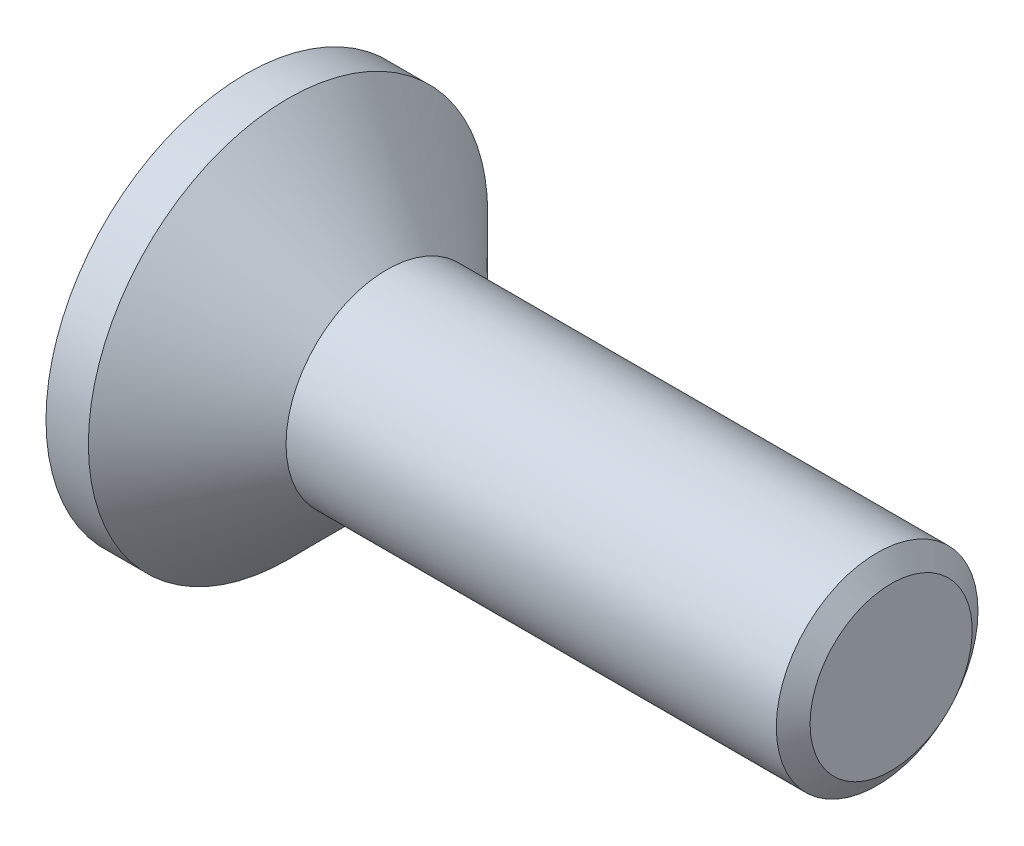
ISO-10303-21;
HEADER;
FILE_DESCRIPTION(('STEP AP214'),'2;1');
FILE_NAME('part.step','',(''),(''),'','','');
FILE_SCHEMA(('AUTOMOTIVE_DESIGN { 1 0 10303 214 1 1 1 1 }'));
ENDSEC;
DATA;
#1=APPLICATION_CONTEXT('core data for automotive mechanical design processes');
#2=APPLICATION_PROTOCOL_DEFINITION('international standard','automotive_design',2000,#1);
#3=PRODUCT_CONTEXT('',#1,'mechanical');
#4=PRODUCT('Part','Part','',(#3));
#5=PRODUCT_RELATED_PRODUCT_CATEGORY('part','',(#4));
#6=PRODUCT_DEFINITION_FORMATION('','',#4);
#7=PRODUCT_DEFINITION_CONTEXT('part definition',#1,'design');
#8=PRODUCT_DEFINITION('design','',#6,#7);
#9=PRODUCT_DEFINITION_SHAPE('','',#8);
#10=(LENGTH_UNIT() NAMED_UNIT(*) SI_UNIT(.MILLI.,.METRE.));
#11=(NAMED_UNIT(*) PLANE_ANGLE_UNIT() SI_UNIT($,.RADIAN.));
#12=(NAMED_UNIT(*) SI_UNIT($,.STERADIAN.) SOLID_ANGLE_UNIT());
#13=UNCERTAINTY_MEASURE_WITH_UNIT(LENGTH_MEASURE(1.E-05),#10,'distance_accuracy_value','');
#14=(GEOMETRIC_REPRESENTATION_CONTEXT(3) GLOBAL_UNCERTAINTY_ASSIGNED_CONTEXT((#13)) GLOBAL_UNIT_ASSIGNED_CONTEXT((#10,
#11,#12)) REPRESENTATION_CONTEXT('',''));
#15=CARTESIAN_POINT('',(0.,0.,0.));
#16=DIRECTION('',(0.,0.,1.));
#17=DIRECTION('',(1.,0.,0.));
#18=AXIS2_PLACEMENT_3D('',#15,#16,#17);
#19=CARTESIAN_POINT('',(0.67468060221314,0.,0.));
#20=DIRECTION('',(-1.,0.,0.));
#21=DIRECTION('',(0.,-1.,0.));
#22=AXIS2_PLACEMENT_3D('',#19,#20,#21);
#23=CONICAL_SURFACE('',#22,0.,1.30899693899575);
#24=CARTESIAN_POINT('',(0.0450000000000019,0.,0.));
#25=DIRECTION('',(-1.,0.,0.));
#26=DIRECTION('',(0.,-1.,0.));
#27=AXIS2_PLACEMENT_3D('',#24,#25,#26);
#28=CIRCLE('',#27,2.35);
#29=CARTESIAN_POINT('',(0.0450000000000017,-2.35,0.));
#30=VERTEX_POINT('',#29);
#31=EDGE_CURVE('E366',#30,#30,#28,.T.);
#32=ORIENTED_EDGE('',*,*,#31,.T.);
#33=EDGE_LOOP('',(#32));
#34=FACE_BOUND('',#33,.T.);
#35=CARTESIAN_POINT('',(0.228098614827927,0.,0.));
#36=DIRECTION('',(-1.,0.,0.));
#37=DIRECTION('',(0.,-1.,0.));
#38=AXIS2_PLACEMENT_3D('',#35,#36,#37);
#39=CIRCLE('',#38,1.6666666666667);
#40=CARTESIAN_POINT('',(0.228098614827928,1.00264207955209,1.3313476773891));
#41=VERTEX_POINT('',#40);
#42=CARTESIAN_POINT('',(0.228098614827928,0.651659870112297,1.53398735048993));
#43=VERTEX_POINT('',#42);
#44=EDGE_CURVE('E465',#41,#43,#39,.F.);
#45=ORIENTED_EDGE('',*,*,#44,.T.);
#46=CARTESIAN_POINT('',(0.228298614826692,0.653091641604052,1.532566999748));
#47=CARTESIAN_POINT('',(0.22388564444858,0.621176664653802,1.56408791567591));
#48=CARTESIAN_POINT('',(0.218088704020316,0.592129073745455,1.5982518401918));
#49=CARTESIAN_POINT('',(0.204454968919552,0.540923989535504,1.669834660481));
#50=CARTESIAN_POINT('',(0.196668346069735,0.518622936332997,1.70716022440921));
#51=CARTESIAN_POINT('',(0.182242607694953,0.486578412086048,1.77233183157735));
#52=CARTESIAN_POINT('',(0.176021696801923,0.475094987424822,1.79943396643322));
#53=CARTESIAN_POINT('',(0.162897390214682,0.455078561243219,1.85506718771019));
#54=CARTESIAN_POINT('',(0.155984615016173,0.446596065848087,1.88361425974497));
#55=CARTESIAN_POINT('',(0.148854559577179,0.439753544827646,1.9125030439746));
#56=B_SPLINE_CURVE_WITH_KNOTS('',3,(#46,#47,#48,#49,#50,#51,#52,#53,#54,#55),.UNSPECIFIED.,.F.,
.F.,(4,2,2,2,4),(0.,0.134982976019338,0.266850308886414,0.356933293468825,0.448467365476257),.UNSPECIFIED.);
#57=CARTESIAN_POINT('',(0.148903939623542,0.43980094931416,1.9123030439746));
#58=VERTEX_POINT('',#57);
#59=EDGE_CURVE('E355',#43,#58,#56,.T.);
#60=ORIENTED_EDGE('',*,*,#59,.T.);
#61=CARTESIAN_POINT('',(0.148953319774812,0.439848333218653,1.91210304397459));
#62=CARTESIAN_POINT('',(0.142820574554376,0.433993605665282,1.93693413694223));
#63=CARTESIAN_POINT('',(0.136909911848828,0.425982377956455,1.96131383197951));
#64=CARTESIAN_POINT('',(0.125641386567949,0.405906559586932,2.00848949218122));
#65=CARTESIAN_POINT('',(0.120283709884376,0.393840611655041,2.03128492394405));
#66=CARTESIAN_POINT('',(0.110228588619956,0.365904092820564,2.0746170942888));
#67=CARTESIAN_POINT('',(0.105531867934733,0.350029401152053,2.09515135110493));
#68=CARTESIAN_POINT('',(0.0969021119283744,0.314913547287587,2.13327568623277));
#69=CARTESIAN_POINT('',(0.0929686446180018,0.295674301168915,2.15086742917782));
#70=CARTESIAN_POINT('',(0.086009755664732,0.254755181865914,2.18224039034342));
#71=CARTESIAN_POINT('',(0.082968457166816,0.233128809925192,2.19608784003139));
#72=CARTESIAN_POINT('',(0.0777550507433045,0.187756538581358,2.21995686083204));
#73=CARTESIAN_POINT('',(0.0755830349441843,0.164010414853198,2.22997802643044));
#74=CARTESIAN_POINT('',(0.0721902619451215,0.115636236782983,2.24568124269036));
#75=CARTESIAN_POINT('',(0.0709497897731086,0.0910387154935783,2.25145316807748));
#76=CARTESIAN_POINT('',(0.0693673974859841,0.0412008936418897,2.25882234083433));
#77=CARTESIAN_POINT('',(0.0690253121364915,0.0159607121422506,2.26042035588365));
#78=CARTESIAN_POINT('',(0.0692446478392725,-0.0341234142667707,2.25939721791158));
#79=CARTESIAN_POINT('',(0.0697952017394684,-0.0589684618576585,2.25682681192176));
#80=CARTESIAN_POINT('',(0.0717688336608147,-0.107865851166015,2.24764508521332));
#81=CARTESIAN_POINT('',(0.0731919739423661,-0.131918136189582,2.24103347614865));
#82=CARTESIAN_POINT('',(0.0768843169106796,-0.178560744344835,2.22397704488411));
#83=CARTESIAN_POINT('',(0.0791537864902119,-0.201150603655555,2.21353101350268));
#84=CARTESIAN_POINT('',(0.0844954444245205,-0.244239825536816,2.18913496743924));
#85=CARTESIAN_POINT('',(0.0875675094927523,-0.264739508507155,2.17518549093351));
#86=CARTESIAN_POINT('',(0.0944997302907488,-0.303348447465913,2.14401587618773));
#87=CARTESIAN_POINT('',(0.0983690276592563,-0.321425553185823,2.12675797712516));
#88=CARTESIAN_POINT('',(0.106801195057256,-0.354438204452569,2.08959540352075));
#89=CARTESIAN_POINT('',(0.111364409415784,-0.369372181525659,2.06968941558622));
#90=CARTESIAN_POINT('',(0.12113590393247,-0.39582442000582,2.02765264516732));
#91=CARTESIAN_POINT('',(0.126348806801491,-0.407315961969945,2.00550615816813));
#92=CARTESIAN_POINT('',(0.137289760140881,-0.426493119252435,1.95974792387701));
#93=CARTESIAN_POINT('',(0.143017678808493,-0.434179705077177,1.93613655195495));
#94=CARTESIAN_POINT('',(0.148953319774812,-0.439848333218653,1.91210304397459));
#95=B_SPLINE_CURVE_WITH_KNOTS('',3,(#61,#62,#63,#64,#65,#66,#67,#68,#69,#70,#71,#72,#73,#74,#75,
#76,#77,#78,#79,#80,#81,#82,#83,#84,#85,#86,#87,#88,#89,#90,#91,#92,#93,#94),.UNSPECIFIED.,.F.,
.F.,(4,2,2,2,2,2,2,2,2,2,2,2,2,2,2,2,4),(0.,0.0786310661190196,0.157288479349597,
0.236031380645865,0.31472958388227,0.391927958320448,0.469134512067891,0.54465708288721,
0.620165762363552,0.694762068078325,0.769363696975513,0.843988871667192,0.918602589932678,
0.994124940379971,1.06968488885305,1.14581696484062,1.22192961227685),.UNSPECIFIED.);
#96=CARTESIAN_POINT('',(0.148903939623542,-0.43980094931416,1.9123030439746));
#97=VERTEX_POINT('',#96);
#98=EDGE_CURVE('E42',#58,#97,#95,.T.);
#99=ORIENTED_EDGE('',*,*,#98,.T.);
#100=CARTESIAN_POINT('',(0.111885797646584,-0.419306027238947,2.05809950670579));
#101=CARTESIAN_POINT('',(0.118238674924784,-0.420441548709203,2.03366731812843));
#102=CARTESIAN_POINT('',(0.124515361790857,-0.422711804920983,2.00927724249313));
#103=CARTESIAN_POINT('',(0.136862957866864,-0.429523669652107,1.96068535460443));
#104=CARTESIAN_POINT('',(0.142933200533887,-0.434072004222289,1.93648431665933));
#105=CARTESIAN_POINT('',(0.15926249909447,-0.449739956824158,1.87035129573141));
#106=CARTESIAN_POINT('',(0.169210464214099,-0.463227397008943,1.82887850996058));
#107=CARTESIAN_POINT('',(0.187673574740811,-0.496982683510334,1.748470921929));
#108=CARTESIAN_POINT('',(0.196189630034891,-0.51724619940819,1.70953451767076));
#109=CARTESIAN_POINT('',(0.208836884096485,-0.556614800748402,1.64720003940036));
#110=CARTESIAN_POINT('',(0.213499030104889,-0.574013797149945,1.62281821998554));
#111=CARTESIAN_POINT('',(0.221744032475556,-0.611555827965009,1.57608754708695));
#112=CARTESIAN_POINT('',(0.225327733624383,-0.631696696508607,1.55373711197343));
#113=CARTESIAN_POINT('',(0.231199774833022,-0.673984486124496,1.5118937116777));
#114=CARTESIAN_POINT('',(0.233516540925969,-0.696073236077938,1.49234599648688));
#115=CARTESIAN_POINT('',(0.236882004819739,-0.742365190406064,1.45578586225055));
#116=CARTESIAN_POINT('',(0.237929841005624,-0.766569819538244,1.43877517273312));
#117=CARTESIAN_POINT('',(0.238865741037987,-0.827579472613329,1.40083184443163));
#118=CARTESIAN_POINT('',(0.238060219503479,-0.86532268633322,1.38136396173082));
#119=CARTESIAN_POINT('',(0.23380567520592,-0.943316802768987,1.34874814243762));
#120=CARTESIAN_POINT('',(0.23035488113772,-0.983569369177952,1.3356044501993));
#121=CARTESIAN_POINT('',(0.221133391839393,-1.06529559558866,1.31594844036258));
#122=CARTESIAN_POINT('',(0.215368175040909,-1.10676615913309,1.30942059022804));
#123=CARTESIAN_POINT('',(0.20195274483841,-1.18993030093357,1.30297349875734));
#124=CARTESIAN_POINT('',(0.19430131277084,-1.23162400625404,1.30305854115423));
#125=CARTESIAN_POINT('',(0.177287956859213,-1.31567380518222,1.30982623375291));
#126=CARTESIAN_POINT('',(0.167874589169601,-1.35800014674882,1.31674505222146));
#127=CARTESIAN_POINT('',(0.148015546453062,-1.44071606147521,1.3371913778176));
#128=CARTESIAN_POINT('',(0.137571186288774,-1.48110800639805,1.35071055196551));
#129=CARTESIAN_POINT('',(0.126839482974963,-1.52005740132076,1.36736813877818));
#130=B_SPLINE_CURVE_WITH_KNOTS('',3,(#100,#101,#102,#103,#104,#105,#106,#107,#108,#109,#110,
#111,#112,#113,#114,#115,#116,#117,#118,#119,#120,#121,#122,#123,#124,#125,#126,#127,#128,#129),
.UNSPECIFIED.,.F.,.F.,(4,2,2,2,2,2,2,2,2,2,2,2,2,2,4),(0.,0.0757664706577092,0.151757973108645,
0.285327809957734,0.418812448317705,0.509561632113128,0.600239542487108,0.688789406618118,
0.777399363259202,0.904160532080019,1.03100665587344,1.15755427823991,1.28418387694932,
1.41534840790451,1.54634776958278),.UNSPECIFIED.);
#131=CARTESIAN_POINT('',(0.228098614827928,-0.651659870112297,1.53398735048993));
#132=VERTEX_POINT('',#131);
#133=EDGE_CURVE('E455',#97,#132,#130,.T.);
#134=ORIENTED_EDGE('',*,*,#133,.T.);
#135=CARTESIAN_POINT('',(0.228098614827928,-1.00264207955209,1.3313476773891));
#136=VERTEX_POINT('',#135);
#137=EDGE_CURVE('E397',#132,#136,#39,.F.);
#138=ORIENTED_EDGE('',*,*,#137,.T.);
#139=CARTESIAN_POINT('',(0.148903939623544,-1.4362025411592,1.3370303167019));
#140=VERTEX_POINT('',#139);
#141=EDGE_CURVE('E449',#136,#140,#130,.T.);
#142=ORIENTED_EDGE('',*,*,#141,.T.);
#143=CARTESIAN_POINT('',(0.148954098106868,-1.4360025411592,1.33697042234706));
#144=CARTESIAN_POINT('',(0.142821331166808,-1.46043421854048,1.34431580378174));
#145=CARTESIAN_POINT('',(0.136910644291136,-1.48555323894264,1.34956790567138));
#146=CARTESIAN_POINT('',(0.125642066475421,-1.53644644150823,1.3557699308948));
#147=CARTESIAN_POINT('',(0.120284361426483,-1.56222084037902,1.3567184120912));
#148=CARTESIAN_POINT('',(0.110229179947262,-1.61371589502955,1.35419112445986));
#149=CARTESIAN_POINT('',(0.105532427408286,-1.63943646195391,1.35071054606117));
#150=CARTESIAN_POINT('',(0.096902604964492,-1.6900111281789,1.33936184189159));
#151=CARTESIAN_POINT('',(0.0929691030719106,-1.71486571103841,1.3314962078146));
#152=CARTESIAN_POINT('',(0.0860101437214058,-1.76249520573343,1.31174601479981));
#153=CARTESIAN_POINT('',(0.0829688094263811,-1.78530072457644,1.299940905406));
#154=CARTESIAN_POINT('',(0.0777553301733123,-1.82865824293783,1.27258216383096));
#155=CARTESIAN_POINT('',(0.0755832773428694,-1.84921000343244,1.25702813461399));
#156=CARTESIAN_POINT('',(0.0721904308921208,-1.88699672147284,1.22298672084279));
#157=CARTESIAN_POINT('',(0.0709499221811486,-1.90429424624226,1.20457071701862));
#158=CARTESIAN_POINT('',(0.0693674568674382,-1.93559532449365,1.16509468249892));
#159=CARTESIAN_POINT('',(0.069025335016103,-1.94959948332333,1.14403513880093));
#160=CARTESIAN_POINT('',(0.0692445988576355,-1.97375578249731,1.10014959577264));
#161=CARTESIAN_POINT('',(0.0697951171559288,-1.9839524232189,1.07734801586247));
#162=CARTESIAN_POINT('',(0.0717686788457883,-2.00044982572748,1.03041087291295));
#163=CARTESIAN_POINT('',(0.073191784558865,-2.00675030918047,1.00627521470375));
#164=CARTESIAN_POINT('',(0.0768840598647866,-2.01530063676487,0.957353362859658));
#165=CARTESIAN_POINT('',(0.0791534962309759,-2.01754920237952,0.932566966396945));
#166=CARTESIAN_POINT('',(0.0844950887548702,-2.01796654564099,0.883052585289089));
#167=CARTESIAN_POINT('',(0.0875671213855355,-2.01613595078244,0.858324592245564));
#168=CARTESIAN_POINT('',(0.0944992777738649,-2.00844706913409,0.809303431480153));
#169=CARTESIAN_POINT('',(0.0983685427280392,-2.00254000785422,0.785019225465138));
#170=CARTESIAN_POINT('',(0.106800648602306,-1.98686292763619,0.737848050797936));
#171=CARTESIAN_POINT('',(0.111363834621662,-1.97709098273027,0.714961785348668));
#172=CARTESIAN_POINT('',(0.121138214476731,-1.95390551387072,0.671021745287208));
#173=CARTESIAN_POINT('',(0.126354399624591,-1.94046288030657,0.64998447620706));
#174=CARTESIAN_POINT('',(0.137302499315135,-1.91040208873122,0.610476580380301));
#175=CARTESIAN_POINT('',(0.143034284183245,-1.89378472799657,0.592005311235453));
#176=CARTESIAN_POINT('',(0.148973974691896,-1.87579142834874,0.57507272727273));
#177=B_SPLINE_CURVE_WITH_KNOTS('',3,(#143,#144,#145,#146,#147,#148,#149,#150,#151,#152,#153,
#154,#155,#156,#157,#158,#159,#160,#161,#162,#163,#164,#165,#166,#167,#168,#169,#170,#171,#172,
#173,#174,#175,#176),.UNSPECIFIED.,.F.,.F.,(4,2,2,2,2,2,2,2,2,2,2,2,2,2,2,2,4),(0.,
0.078631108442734,0.157288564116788,0.236031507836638,0.314729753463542,0.391928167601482,
0.469134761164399,0.544657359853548,0.620166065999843,0.694762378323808,0.769364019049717,
0.8439891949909,0.918602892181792,0.994125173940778,1.06968513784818,1.14586264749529,
1.22202105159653),.UNSPECIFIED.);
#178=CARTESIAN_POINT('',(0.14890393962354,-1.8760034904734,0.57527272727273));
#179=VERTEX_POINT('',#178);
#180=EDGE_CURVE('E340',#140,#179,#177,.T.);
#181=ORIENTED_EDGE('',*,*,#180,.T.);
#182=CARTESIAN_POINT('',(0.148837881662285,-1.87620349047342,0.575461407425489));
#183=CARTESIAN_POINT('',(0.159358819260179,-1.84430359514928,0.545428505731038));
#184=CARTESIAN_POINT('',(0.169422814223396,-1.81483451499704,0.512583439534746));
#185=CARTESIAN_POINT('',(0.187858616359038,-1.76221042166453,0.443029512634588));
#186=CARTESIAN_POINT('',(0.196264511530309,-1.73892378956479,0.406429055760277));
#187=CARTESIAN_POINT('',(0.208783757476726,-1.70496620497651,0.341833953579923));
#188=CARTESIAN_POINT('',(0.213412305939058,-1.69263787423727,0.314800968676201));
#189=CARTESIAN_POINT('',(0.221681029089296,-1.67087470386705,0.258932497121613));
#190=CARTESIAN_POINT('',(0.225303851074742,-1.6614903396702,0.230074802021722));
#191=CARTESIAN_POINT('',(0.228298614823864,-1.65378777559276,0.200689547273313));
#192=B_SPLINE_CURVE_WITH_KNOTS('',3,(#182,#183,#184,#185,#186,#187,#188,#189,#190,#191),
.UNSPECIFIED.,.F.,.F.,(4,2,2,2,4),(0.,0.135109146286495,0.267056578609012,0.357070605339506,
0.448552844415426),.UNSPECIFIED.);
#193=CARTESIAN_POINT('',(0.228098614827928,-1.65430194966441,0.20263967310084));
#194=VERTEX_POINT('',#193);
#195=EDGE_CURVE('E321',#179,#194,#192,.T.);
#196=ORIENTED_EDGE('',*,*,#195,.T.);
#197=CARTESIAN_POINT('',(0.228098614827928,-1.65430194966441,-0.20263967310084));
#198=VERTEX_POINT('',#197);
#199=EDGE_CURVE('E394',#194,#198,#39,.F.);
#200=ORIENTED_EDGE('',*,*,#199,.T.);
#201=CARTESIAN_POINT('',(0.228298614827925,-1.65378777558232,-0.20068954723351));
#202=CARTESIAN_POINT('',(0.223885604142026,-1.6651283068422,-0.244089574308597));
#203=CARTESIAN_POINT('',(0.218088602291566,-1.6801914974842,-0.286327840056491));
#204=CARTESIAN_POINT('',(0.204454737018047,-1.71658185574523,-0.366464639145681));
#205=CARTESIAN_POINT('',(0.196668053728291,-1.737756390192,-0.404440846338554));
#206=CARTESIAN_POINT('',(0.182240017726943,-1.77818086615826,-0.464787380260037));
#207=CARTESIAN_POINT('',(0.176016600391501,-1.79591755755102,-0.488291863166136));
#208=CARTESIAN_POINT('',(0.16288680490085,-1.83410567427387,-0.533458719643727));
#209=CARTESIAN_POINT('',(0.155971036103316,-1.85459624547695,-0.55508529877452));
#210=CARTESIAN_POINT('',(0.148837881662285,-1.87620349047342,-0.575461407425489));
#211=B_SPLINE_CURVE_WITH_KNOTS('',3,(#201,#202,#203,#204,#205,#206,#207,#208,#209,#210),
.UNSPECIFIED.,.F.,.F.,(4,2,2,2,4),(0.,0.134984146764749,0.266852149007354,0.356969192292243,
0.448538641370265),.UNSPECIFIED.);
#212=CARTESIAN_POINT('',(0.14890393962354,-1.8760034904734,-0.57527272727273));
#213=VERTEX_POINT('',#212);
#214=EDGE_CURVE('E315',#198,#213,#211,.T.);
#215=ORIENTED_EDGE('',*,*,#214,.T.);
#216=CARTESIAN_POINT('',(0.148973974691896,-1.87579142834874,-0.57507272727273));
#217=CARTESIAN_POINT('',(0.142840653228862,-1.89437192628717,-0.59255525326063));
#218=CARTESIAN_POINT('',(0.136929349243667,-1.9114835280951,-0.611679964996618));
#219=CARTESIAN_POINT('',(0.125659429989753,-1.94230894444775,-0.652648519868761));
#220=CARTESIAN_POINT('',(0.120301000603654,-1.95602161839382,-0.674493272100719));
#221=CARTESIAN_POINT('',(0.110244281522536,-1.97958890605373,-0.720349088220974));
#222=CARTESIAN_POINT('',(0.10554671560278,-1.98943931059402,-0.744362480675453));
#223=CARTESIAN_POINT('',(0.0969151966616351,-2.0049073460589,-0.793833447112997));
#224=CARTESIAN_POINT('',(0.0929808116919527,-2.0105273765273,-0.819290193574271));
#225=CARTESIAN_POINT('',(0.0860200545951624,-2.0172470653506,-0.870412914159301));
#226=CARTESIAN_POINT('',(0.0829778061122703,-2.01843083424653,-0.896065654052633));
#227=CARTESIAN_POINT('',(0.077762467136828,-2.0164251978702,-0.947294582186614));
#228=CARTESIAN_POINT('',(0.0755894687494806,-2.0132353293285,-0.972870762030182));
#229=CARTESIAN_POINT('',(0.0721947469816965,-2.00265650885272,-1.02261800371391));
#230=CARTESIAN_POINT('',(0.0709533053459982,-1.99536067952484,-1.04680754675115));
#231=CARTESIAN_POINT('',(0.0693689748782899,-1.9768319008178,-1.09365666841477));
#232=CARTESIAN_POINT('',(0.0690259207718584,-1.96559967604,-1.11631652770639));
#233=CARTESIAN_POINT('',(0.0692433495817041,-1.93967899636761,-1.1591839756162));
#234=CARTESIAN_POINT('',(0.0697929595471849,-1.9250339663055,-1.17941789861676));
#235=CARTESIAN_POINT('',(0.071764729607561,-1.89264019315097,-1.21717933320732));
#236=CARTESIAN_POINT('',(0.0731869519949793,-1.874891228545,-1.23470665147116));
#237=CARTESIAN_POINT('',(0.0768774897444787,-1.8368041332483,-1.26657891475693));
#238=CARTESIAN_POINT('',(0.0791460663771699,-1.81646520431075,-1.28092287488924));
#239=CARTESIAN_POINT('',(0.0844859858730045,-1.77379741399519,-1.30604873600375));
#240=CARTESIAN_POINT('',(0.0875572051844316,-1.75146885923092,-1.31683118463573));
#241=CARTESIAN_POINT('',(0.0944877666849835,-1.70517395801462,-1.33469081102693));
#242=CARTESIAN_POINT('',(0.0983562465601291,-1.68119098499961,-1.34172129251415));
#243=CARTESIAN_POINT('',(0.106786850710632,-1.63250291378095,-1.3517383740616));
#244=CARTESIAN_POINT('',(0.111349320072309,-1.60779746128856,-1.35472295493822));
#245=CARTESIAN_POINT('',(0.121122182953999,-1.55815287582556,-1.35662221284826));
#246=CARTESIAN_POINT('',(0.126337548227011,-1.53321347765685,-1.35550356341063));
#247=CARTESIAN_POINT('',(0.137284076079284,-1.48396895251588,-1.34923304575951));
#248=CARTESIAN_POINT('',(0.14301510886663,-1.45966366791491,-1.34408218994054));
#249=CARTESIAN_POINT('',(0.148954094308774,-1.436002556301,-1.33697042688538));
#250=B_SPLINE_CURVE_WITH_KNOTS('',3,(#216,#217,#218,#219,#220,#221,#222,#223,#224,#225,#226,
#227,#228,#229,#230,#231,#232,#233,#234,#235,#236,#237,#238,#239,#240,#241,#242,#243,#244,#245,
#246,#247,#248,#249),.UNSPECIFIED.,.F.,.F.,(4,2,2,2,2,2,2,2,2,2,2,2,2,2,2,2,4),(0.,
0.0786321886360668,0.157290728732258,0.23603475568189,0.31473408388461,0.391933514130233,
0.469141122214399,0.544664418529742,0.620173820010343,0.694770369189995,0.769372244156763,
0.843997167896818,0.918610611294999,0.994132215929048,1.06969149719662,1.14586582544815,
1.22202103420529),.UNSPECIFIED.);
#251=CARTESIAN_POINT('',(0.148903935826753,-1.436202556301,-1.3370303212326));
#252=VERTEX_POINT('',#251);
#253=EDGE_CURVE('E279',#213,#252,#250,.T.);
#254=ORIENTED_EDGE('',*,*,#253,.T.);
#255=CARTESIAN_POINT('',(0.148853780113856,-1.436402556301,-1.33709019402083));
#256=CARTESIAN_POINT('',(0.159374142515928,-1.39444257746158,-1.32448410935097));
#257=CARTESIAN_POINT('',(0.169437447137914,-1.35126285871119,-1.31538931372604));
#258=CARTESIAN_POINT('',(0.187871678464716,-1.26471476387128,-1.30459967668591));
#259=CARTESIAN_POINT('',(0.196276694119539,-1.22137444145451,-1.30273667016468));
#260=CARTESIAN_POINT('',(0.208792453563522,-1.14846551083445,-1.30563167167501));
#261=CARTESIAN_POINT('',(0.213418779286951,-1.11890087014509,-1.30847234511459));
#262=CARTESIAN_POINT('',(0.221683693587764,-1.05965761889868,-1.31755833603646));
#263=CARTESIAN_POINT('',(0.225304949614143,-1.02998500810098,-1.32385840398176));
#264=CARTESIAN_POINT('',(0.228298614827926,-1.00069613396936,-1.3318774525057));
#265=B_SPLINE_CURVE_WITH_KNOTS('',3,(#255,#256,#257,#258,#259,#260,#261,#262,#263,#264),
.UNSPECIFIED.,.F.,.F.,(4,2,2,2,4),(0.,0.135107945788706,0.267054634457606,0.357036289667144,
0.448484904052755),.UNSPECIFIED.);
#266=CARTESIAN_POINT('',(0.228098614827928,-1.0026420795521,-1.33134767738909));
#267=VERTEX_POINT('',#266);
#268=EDGE_CURVE('E305',#252,#267,#265,.T.);
#269=ORIENTED_EDGE('',*,*,#268,.T.);
#270=CARTESIAN_POINT('',(0.228098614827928,-0.651659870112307,-1.53398735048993));
#271=VERTEX_POINT('',#270);
#272=EDGE_CURVE('E374',#267,#271,#39,.F.);
#273=ORIENTED_EDGE('',*,*,#272,.T.);
#274=CARTESIAN_POINT('',(0.228298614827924,-0.653091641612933,-1.53256699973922));
#275=CARTESIAN_POINT('',(0.223885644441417,-0.621176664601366,-1.56408791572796));
#276=CARTESIAN_POINT('',(0.218088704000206,-0.592129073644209,-1.5982518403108));
#277=CARTESIAN_POINT('',(0.204454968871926,-0.540923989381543,-1.66983466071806));
#278=CARTESIAN_POINT('',(0.196668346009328,-0.518622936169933,-1.70716022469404));
#279=CARTESIAN_POINT('',(0.182242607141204,-0.486578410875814,-1.77233183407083));
#280=CARTESIAN_POINT('',(0.176021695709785,-0.475094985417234,-1.79943397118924));
#281=CARTESIAN_POINT('',(0.16289738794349,-0.455078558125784,-1.85506719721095));
#282=CARTESIAN_POINT('',(0.155984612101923,-0.446596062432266,-1.88361427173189));
#283=CARTESIAN_POINT('',(0.148854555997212,-0.439753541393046,-1.9125030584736));
#284=B_SPLINE_CURVE_WITH_KNOTS('',3,(#274,#275,#276,#277,#278,#279,#280,#281,#282,#283),
.UNSPECIFIED.,.F.,.F.,(4,2,2,2,4),(0.,0.134982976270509,0.266850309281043,0.356933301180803,
0.448467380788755),.UNSPECIFIED.);
#285=CARTESIAN_POINT('',(0.148903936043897,-0.43980094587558,-1.9123030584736));
#286=VERTEX_POINT('',#285);
#287=EDGE_CURVE('E299',#271,#286,#284,.T.);
#288=ORIENTED_EDGE('',*,*,#287,.T.);
#289=CARTESIAN_POINT('',(0.148953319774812,-0.439848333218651,-1.91210304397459));
#290=CARTESIAN_POINT('',(0.142820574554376,-0.433993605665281,-1.93693413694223));
#291=CARTESIAN_POINT('',(0.136909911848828,-0.425982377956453,-1.96131383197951));
#292=CARTESIAN_POINT('',(0.125641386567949,-0.405906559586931,-2.00848949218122));
#293=CARTESIAN_POINT('',(0.120283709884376,-0.393840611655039,-2.03128492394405));
#294=CARTESIAN_POINT('',(0.110228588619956,-0.365904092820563,-2.0746170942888));
#295=CARTESIAN_POINT('',(0.105531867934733,-0.350029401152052,-2.09515135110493));
#296=CARTESIAN_POINT('',(0.0969021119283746,-0.314913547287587,-2.13327568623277));
#297=CARTESIAN_POINT('',(0.0929686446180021,-0.295674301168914,-2.15086742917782));
#298=CARTESIAN_POINT('',(0.0860097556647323,-0.254755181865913,-2.18224039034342));
#299=CARTESIAN_POINT('',(0.0829684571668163,-0.233128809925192,-2.19608784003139));
#300=CARTESIAN_POINT('',(0.0777550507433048,-0.187756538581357,-2.21995686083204));
#301=CARTESIAN_POINT('',(0.0755830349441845,-0.164010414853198,-2.22997802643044));
#302=CARTESIAN_POINT('',(0.0721902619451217,-0.115636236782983,-2.24568124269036));
#303=CARTESIAN_POINT('',(0.0709497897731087,-0.0910387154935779,-2.25145316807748));
#304=CARTESIAN_POINT('',(0.0693673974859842,-0.0412008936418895,-2.25882234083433));
#305=CARTESIAN_POINT('',(0.0690253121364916,-0.0159607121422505,-2.26042035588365));
#306=CARTESIAN_POINT('',(0.0692446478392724,0.0341234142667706,-2.25939721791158));
#307=CARTESIAN_POINT('',(0.0697952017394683,0.0589684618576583,-2.25682681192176));
#308=CARTESIAN_POINT('',(0.0717688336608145,0.107865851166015,-2.24764508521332));
#309=CARTESIAN_POINT('',(0.0731919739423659,0.131918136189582,-2.24103347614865));
#310=CARTESIAN_POINT('',(0.0768843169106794,0.178560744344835,-2.22397704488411));
#311=CARTESIAN_POINT('',(0.0791537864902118,0.201150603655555,-2.21353101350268));
#312=CARTESIAN_POINT('',(0.0844954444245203,0.244239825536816,-2.18913496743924));
#313=CARTESIAN_POINT('',(0.087567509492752,0.264739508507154,-2.17518549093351));
#314=CARTESIAN_POINT('',(0.0944997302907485,0.303348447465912,-2.14401587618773));
#315=CARTESIAN_POINT('',(0.098369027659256,0.321425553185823,-2.12675797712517));
#316=CARTESIAN_POINT('',(0.106801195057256,0.354438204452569,-2.08959540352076));
#317=CARTESIAN_POINT('',(0.111364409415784,0.369372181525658,-2.06968941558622));
#318=CARTESIAN_POINT('',(0.12113590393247,0.395824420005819,-2.02765264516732));
#319=CARTESIAN_POINT('',(0.12634880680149,0.407315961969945,-2.00550615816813));
#320=CARTESIAN_POINT('',(0.137289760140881,0.426493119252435,-1.95974792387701));
#321=CARTESIAN_POINT('',(0.143017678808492,0.434179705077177,-1.93613655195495));
#322=CARTESIAN_POINT('',(0.148953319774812,0.439848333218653,-1.91210304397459));
#323=B_SPLINE_CURVE_WITH_KNOTS('',3,(#289,#290,#291,#292,#293,#294,#295,#296,#297,#298,#299,
#300,#301,#302,#303,#304,#305,#306,#307,#308,#309,#310,#311,#312,#313,#314,#315,#316,#317,#318,
#319,#320,#321,#322),.UNSPECIFIED.,.F.,.F.,(4,2,2,2,2,2,2,2,2,2,2,2,2,2,2,2,4),(0.,
0.0786310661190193,0.157288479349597,0.236031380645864,0.314729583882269,0.391927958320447,
0.46913451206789,0.544657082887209,0.620165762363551,0.694762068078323,0.769363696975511,
0.84398887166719,0.918602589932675,0.994124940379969,1.06968488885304,1.14581696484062,
1.22192961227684),.UNSPECIFIED.);
#324=CARTESIAN_POINT('',(0.148903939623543,0.43980094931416,-1.9123030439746));
#325=VERTEX_POINT('',#324);
#326=EDGE_CURVE('E268',#286,#325,#323,.T.);
#327=ORIENTED_EDGE('',*,*,#326,.T.);
#328=CARTESIAN_POINT('',(0.111885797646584,0.419306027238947,-2.05809950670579));
#329=CARTESIAN_POINT('',(0.118238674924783,0.420441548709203,-2.03366731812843));
#330=CARTESIAN_POINT('',(0.124515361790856,0.422711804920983,-2.00927724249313));
#331=CARTESIAN_POINT('',(0.136862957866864,0.429523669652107,-1.96068535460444));
#332=CARTESIAN_POINT('',(0.142933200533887,0.434072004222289,-1.93648431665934));
#333=CARTESIAN_POINT('',(0.159262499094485,0.449739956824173,-1.87035129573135));
#334=CARTESIAN_POINT('',(0.169210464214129,0.463227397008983,-1.82887850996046));
#335=CARTESIAN_POINT('',(0.187673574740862,0.496982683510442,-1.74847092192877));
#336=CARTESIAN_POINT('',(0.19618963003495,0.517246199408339,-1.70953451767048));
#337=CARTESIAN_POINT('',(0.20883688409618,0.556614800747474,-1.64720003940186));
#338=CARTESIAN_POINT('',(0.21349903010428,0.574013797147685,-1.62281821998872));
#339=CARTESIAN_POINT('',(0.221744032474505,0.611555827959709,-1.57608754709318));
#340=CARTESIAN_POINT('',(0.225327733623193,0.631696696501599,-1.55373711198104));
#341=CARTESIAN_POINT('',(0.23119977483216,0.673984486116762,-1.5118937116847));
#342=CARTESIAN_POINT('',(0.233516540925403,0.696073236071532,-1.49234599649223));
#343=CARTESIAN_POINT('',(0.23688200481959,0.742365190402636,-1.45578586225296));
#344=CARTESIAN_POINT('',(0.237929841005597,0.766569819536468,-1.43877517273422));
#345=CARTESIAN_POINT('',(0.238865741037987,0.827579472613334,-1.40083184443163));
#346=CARTESIAN_POINT('',(0.238060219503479,0.865322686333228,-1.38136396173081));
#347=CARTESIAN_POINT('',(0.233805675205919,0.943316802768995,-1.34874814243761));
#348=CARTESIAN_POINT('',(0.23035488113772,0.983569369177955,-1.3356044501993));
#349=CARTESIAN_POINT('',(0.221133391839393,1.06529559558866,-1.31594844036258));
#350=CARTESIAN_POINT('',(0.21536817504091,1.10676615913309,-1.30942059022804));
#351=CARTESIAN_POINT('',(0.20195274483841,1.18993030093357,-1.30297349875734));
#352=CARTESIAN_POINT('',(0.194301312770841,1.23162400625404,-1.30305854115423));
#353=CARTESIAN_POINT('',(0.177287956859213,1.31567380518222,-1.30982623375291));
#354=CARTESIAN_POINT('',(0.167874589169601,1.35800014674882,-1.31674505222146));
#355=CARTESIAN_POINT('',(0.148015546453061,1.44071606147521,-1.3371913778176));
#356=CARTESIAN_POINT('',(0.137571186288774,1.48110800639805,-1.35071055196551));
#357=CARTESIAN_POINT('',(0.126839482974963,1.52005740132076,-1.36736813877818));
#358=B_SPLINE_CURVE_WITH_KNOTS('',3,(#328,#329,#330,#331,#332,#333,#334,#335,#336,#337,#338,
#339,#340,#341,#342,#343,#344,#345,#346,#347,#348,#349,#350,#351,#352,#353,#354,#355,#356,#357),
.UNSPECIFIED.,.F.,.F.,(4,2,2,2,2,2,2,2,2,2,2,2,2,2,4),(0.,0.0757664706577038,0.151757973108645,
0.285327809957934,0.418812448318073,0.509561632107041,0.600239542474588,0.688789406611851,
0.777399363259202,0.90416053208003,1.03100665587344,1.15755427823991,1.28418387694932,
1.41534840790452,1.54634776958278),.UNSPECIFIED.);
#359=CARTESIAN_POINT('',(0.228098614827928,0.651659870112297,-1.53398735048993));
#360=VERTEX_POINT('',#359);
#361=EDGE_CURVE('E821',#325,#360,#358,.T.);
#362=ORIENTED_EDGE('',*,*,#361,.T.);
#363=CARTESIAN_POINT('',(0.228098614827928,1.00264207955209,-1.3313476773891));
#364=VERTEX_POINT('',#363);
#365=EDGE_CURVE('E828',#360,#364,#39,.F.);
#366=ORIENTED_EDGE('',*,*,#365,.T.);
#367=CARTESIAN_POINT('',(0.148903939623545,1.4362025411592,-1.3370303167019));
#368=VERTEX_POINT('',#367);
#369=EDGE_CURVE('E813',#364,#368,#358,.T.);
#370=ORIENTED_EDGE('',*,*,#369,.T.);
#371=CARTESIAN_POINT('',(0.148954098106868,1.4360025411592,-1.33697042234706));
#372=CARTESIAN_POINT('',(0.142821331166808,1.46043421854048,-1.34431580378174));
#373=CARTESIAN_POINT('',(0.136910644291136,1.48555323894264,-1.34956790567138));
#374=CARTESIAN_POINT('',(0.125642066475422,1.53644644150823,-1.3557699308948));
#375=CARTESIAN_POINT('',(0.120284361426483,1.56222084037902,-1.3567184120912));
#376=CARTESIAN_POINT('',(0.110229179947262,1.61371589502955,-1.35419112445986));
#377=CARTESIAN_POINT('',(0.105532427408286,1.63943646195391,-1.35071054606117));
#378=CARTESIAN_POINT('',(0.0969026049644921,1.6900111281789,-1.33936184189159));
#379=CARTESIAN_POINT('',(0.0929691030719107,1.71486571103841,-1.3314962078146));
#380=CARTESIAN_POINT('',(0.0860101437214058,1.76249520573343,-1.31174601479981));
#381=CARTESIAN_POINT('',(0.0829688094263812,1.78530072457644,-1.299940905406));
#382=CARTESIAN_POINT('',(0.0777553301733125,1.82865824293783,-1.27258216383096));
#383=CARTESIAN_POINT('',(0.0755832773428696,1.84921000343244,-1.25702813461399));
#384=CARTESIAN_POINT('',(0.0721904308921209,1.88699672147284,-1.22298672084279));
#385=CARTESIAN_POINT('',(0.0709499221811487,1.90429424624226,-1.20457071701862));
#386=CARTESIAN_POINT('',(0.0693674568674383,1.93559532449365,-1.16509468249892));
#387=CARTESIAN_POINT('',(0.0690253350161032,1.94959948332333,-1.14403513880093));
#388=CARTESIAN_POINT('',(0.0692445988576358,1.97375578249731,-1.10014959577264));
#389=CARTESIAN_POINT('',(0.0697951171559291,1.9839524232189,-1.07734801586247));
#390=CARTESIAN_POINT('',(0.0717686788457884,2.00044982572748,-1.03041087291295));
#391=CARTESIAN_POINT('',(0.0731917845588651,2.00675030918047,-1.00627521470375));
#392=CARTESIAN_POINT('',(0.0768840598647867,2.01530063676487,-0.957353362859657));
#393=CARTESIAN_POINT('',(0.079153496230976,2.01754920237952,-0.932566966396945));
#394=CARTESIAN_POINT('',(0.0844950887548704,2.01796654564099,-0.883052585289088));
#395=CARTESIAN_POINT('',(0.0875671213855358,2.01613595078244,-0.858324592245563));
#396=CARTESIAN_POINT('',(0.0944992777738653,2.00844706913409,-0.809303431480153));
#397=CARTESIAN_POINT('',(0.0983685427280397,2.00254000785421,-0.785019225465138));
#398=CARTESIAN_POINT('',(0.106800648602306,1.98686292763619,-0.737848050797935));
#399=CARTESIAN_POINT('',(0.111363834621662,1.97709098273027,-0.714961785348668));
#400=CARTESIAN_POINT('',(0.121138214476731,1.95390551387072,-0.671021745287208));
#401=CARTESIAN_POINT('',(0.126354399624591,1.94046288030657,-0.649984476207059));
#402=CARTESIAN_POINT('',(0.137302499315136,1.91040208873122,-0.610476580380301));
#403=CARTESIAN_POINT('',(0.143034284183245,1.89378472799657,-0.592005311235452));
#404=CARTESIAN_POINT('',(0.148973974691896,1.87579142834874,-0.57507272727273));
#405=B_SPLINE_CURVE_WITH_KNOTS('',3,(#371,#372,#373,#374,#375,#376,#377,#378,#379,#380,#381,
#382,#383,#384,#385,#386,#387,#388,#389,#390,#391,#392,#393,#394,#395,#396,#397,#398,#399,#400,
#401,#402,#403,#404),.UNSPECIFIED.,.F.,.F.,(4,2,2,2,2,2,2,2,2,2,2,2,2,2,2,2,4),(0.,
0.078631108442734,0.157288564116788,0.236031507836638,0.314729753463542,0.391928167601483,
0.469134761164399,0.544657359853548,0.620166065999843,0.694762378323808,0.769364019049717,
0.8439891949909,0.918602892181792,0.994125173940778,1.06968513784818,1.14586264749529,
1.22202105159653),.UNSPECIFIED.);
#406=CARTESIAN_POINT('',(0.148903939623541,1.8760034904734,-0.57527272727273));
#407=VERTEX_POINT('',#406);
#408=EDGE_CURVE('E261',#368,#407,#405,.T.);
#409=ORIENTED_EDGE('',*,*,#408,.T.);
#410=CARTESIAN_POINT('',(0.148837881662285,1.87620349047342,-0.575461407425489));
#411=CARTESIAN_POINT('',(0.159358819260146,1.84430359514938,-0.545428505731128));
#412=CARTESIAN_POINT('',(0.16942281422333,1.81483451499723,-0.512583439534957));
#413=CARTESIAN_POINT('',(0.1878586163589,1.76221042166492,-0.443029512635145));
#414=CARTESIAN_POINT('',(0.196264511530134,1.73892378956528,-0.406429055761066));
#415=CARTESIAN_POINT('',(0.208783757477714,1.70496620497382,-0.341833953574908));
#416=CARTESIAN_POINT('',(0.213412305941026,1.69263787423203,-0.314800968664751));
#417=CARTESIAN_POINT('',(0.221681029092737,1.67087470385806,-0.258932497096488));
#418=CARTESIAN_POINT('',(0.225303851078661,1.66149033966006,-0.230074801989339));
#419=CARTESIAN_POINT('',(0.228298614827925,1.65378777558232,-0.200689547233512));
#420=B_SPLINE_CURVE_WITH_KNOTS('',3,(#410,#411,#412,#413,#414,#415,#416,#417,#418,#419),
.UNSPECIFIED.,.F.,.F.,(4,2,2,2,4),(0.,0.13510914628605,0.267056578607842,0.357070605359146,
0.448552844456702),.UNSPECIFIED.);
#421=CARTESIAN_POINT('',(0.228098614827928,1.65430194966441,-0.20263967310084));
#422=VERTEX_POINT('',#421);
#423=EDGE_CURVE('E235',#407,#422,#420,.T.);
#424=ORIENTED_EDGE('',*,*,#423,.T.);
#425=CARTESIAN_POINT('',(0.228098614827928,1.65430194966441,0.20263967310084));
#426=VERTEX_POINT('',#425);
#427=EDGE_CURVE('E829',#422,#426,#39,.F.);
#428=ORIENTED_EDGE('',*,*,#427,.T.);
#429=CARTESIAN_POINT('',(0.22829861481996,1.65378777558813,0.200689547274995));
#430=CARTESIAN_POINT('',(0.223885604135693,1.66512830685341,0.24408957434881));
#431=CARTESIAN_POINT('',(0.218088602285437,1.6801914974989,0.28632784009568));
#432=CARTESIAN_POINT('',(0.204454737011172,1.71658185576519,0.366464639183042));
#433=CARTESIAN_POINT('',(0.196668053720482,1.7377563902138,0.404440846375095));
#434=CARTESIAN_POINT('',(0.182240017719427,1.77818086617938,0.464787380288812));
#435=CARTESIAN_POINT('',(0.176016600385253,1.79591755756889,0.488291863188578));
#436=CARTESIAN_POINT('',(0.162886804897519,1.83410567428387,0.53345871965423));
#437=CARTESIAN_POINT('',(0.155971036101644,1.85459624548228,0.555085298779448));
#438=CARTESIAN_POINT('',(0.148837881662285,1.87620349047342,0.575461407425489));
#439=B_SPLINE_CURVE_WITH_KNOTS('',3,(#429,#430,#431,#432,#433,#434,#435,#436,#437,#438),
.UNSPECIFIED.,.F.,.F.,(4,2,2,2,4),(0.,0.13498414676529,0.266852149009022,0.356969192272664,
0.448538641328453),.UNSPECIFIED.);
#440=CARTESIAN_POINT('',(0.148903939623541,1.8760034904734,0.57527272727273));
#441=VERTEX_POINT('',#440);
#442=EDGE_CURVE('E227',#426,#441,#439,.T.);
#443=ORIENTED_EDGE('',*,*,#442,.T.);
#444=CARTESIAN_POINT('',(0.148973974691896,1.87579142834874,0.57507272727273));
#445=CARTESIAN_POINT('',(0.142840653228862,1.89437192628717,0.592555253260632));
#446=CARTESIAN_POINT('',(0.136929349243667,1.9114835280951,0.611679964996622));
#447=CARTESIAN_POINT('',(0.125659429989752,1.94230894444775,0.652648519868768));
#448=CARTESIAN_POINT('',(0.120301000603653,1.95602161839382,0.674493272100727));
#449=CARTESIAN_POINT('',(0.110244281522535,1.97958890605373,0.720349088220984));
#450=CARTESIAN_POINT('',(0.10554671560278,1.98943931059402,0.744362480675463));
#451=CARTESIAN_POINT('',(0.0969151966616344,2.0049073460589,0.79383344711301));
#452=CARTESIAN_POINT('',(0.0929808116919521,2.0105273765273,0.819290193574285));
#453=CARTESIAN_POINT('',(0.0860200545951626,2.0172470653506,0.870412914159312));
#454=CARTESIAN_POINT('',(0.082977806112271,2.01843083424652,0.896065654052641));
#455=CARTESIAN_POINT('',(0.0777624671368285,2.0164251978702,0.947294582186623));
#456=CARTESIAN_POINT('',(0.0755894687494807,2.01323532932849,0.972870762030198));
#457=CARTESIAN_POINT('',(0.0721947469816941,2.0026565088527,1.02261800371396));
#458=CARTESIAN_POINT('',(0.0709533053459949,1.99536067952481,1.04680754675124));
#459=CARTESIAN_POINT('',(0.0693689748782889,1.97683190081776,1.09365666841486));
#460=CARTESIAN_POINT('',(0.0690259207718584,1.96559967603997,1.11631652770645));
#461=CARTESIAN_POINT('',(0.069243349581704,1.93967899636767,1.15918397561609));
#462=CARTESIAN_POINT('',(0.0697929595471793,1.92503396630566,1.17941789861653));
#463=CARTESIAN_POINT('',(0.0717647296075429,1.89264019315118,1.21717933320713));
#464=CARTESIAN_POINT('',(0.0731869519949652,1.87489122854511,1.23470665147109));
#465=CARTESIAN_POINT('',(0.076877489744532,1.83680413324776,1.26657891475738));
#466=CARTESIAN_POINT('',(0.0791460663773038,1.8164652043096,1.28092287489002));
#467=CARTESIAN_POINT('',(0.0844859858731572,1.77379741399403,1.30604873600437));
#468=CARTESIAN_POINT('',(0.0875572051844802,1.75146885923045,1.31683118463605));
#469=CARTESIAN_POINT('',(0.0944877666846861,1.70517395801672,1.33469081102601));
#470=CARTESIAN_POINT('',(0.0983562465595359,1.68119098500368,1.34172129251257));
#471=CARTESIAN_POINT('',(0.106786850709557,1.63250291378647,1.35173837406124));
#472=CARTESIAN_POINT('',(0.111349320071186,1.60779746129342,1.35472295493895));
#473=CARTESIAN_POINT('',(0.121122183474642,1.55815287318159,1.35662221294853));
#474=CARTESIAN_POINT('',(0.126337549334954,1.53321347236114,1.3555035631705));
#475=CARTESIAN_POINT('',(0.137284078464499,1.48396894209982,1.34923304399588));
#476=CARTESIAN_POINT('',(0.143015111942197,1.45966365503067,1.34408218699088));
#477=CARTESIAN_POINT('',(0.148954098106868,1.4360025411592,1.33697042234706));
#478=B_SPLINE_CURVE_WITH_KNOTS('',3,(#444,#445,#446,#447,#448,#449,#450,#451,#452,#453,#454,
#455,#456,#457,#458,#459,#460,#461,#462,#463,#464,#465,#466,#467,#468,#469,#470,#471,#472,#473,
#474,#475,#476,#477),.UNSPECIFIED.,.F.,.F.,(4,2,2,2,2,2,2,2,2,2,2,2,2,2,2,2,4),(0.,
0.0786321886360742,0.157290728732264,0.236034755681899,0.314734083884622,0.391933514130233,
0.469141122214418,0.544664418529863,0.620173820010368,0.694770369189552,0.769372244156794,
0.843997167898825,0.918610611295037,0.994132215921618,1.06969149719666,1.14586583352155,
1.22202105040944),.UNSPECIFIED.);
#479=CARTESIAN_POINT('',(0.148903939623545,1.4362025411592,1.3370303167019));
#480=VERTEX_POINT('',#479);
#481=EDGE_CURVE('E269',#441,#480,#478,.T.);
#482=ORIENTED_EDGE('',*,*,#481,.T.);
#483=CARTESIAN_POINT('',(0.148853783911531,1.4364025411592,1.33709018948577));
#484=CARTESIAN_POINT('',(0.1593741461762,1.39444256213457,1.32448410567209));
#485=CARTESIAN_POINT('',(0.169437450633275,1.35126284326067,1.31538931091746));
#486=CARTESIAN_POINT('',(0.18787168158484,1.26471474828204,1.30459967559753));
#487=CARTESIAN_POINT('',(0.196276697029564,1.2213744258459,1.30273666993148));
#488=CARTESIAN_POINT('',(0.208792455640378,1.1484654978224,1.3056316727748));
#489=CARTESIAN_POINT('',(0.21341878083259,1.11890085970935,1.30847234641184));
#490=CARTESIAN_POINT('',(0.221683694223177,1.05965761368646,1.31755833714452));
#491=CARTESIAN_POINT('',(0.225304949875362,1.02998500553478,1.32385840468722));
#492=CARTESIAN_POINT('',(0.228298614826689,1.00069613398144,1.3318774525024));
#493=B_SPLINE_CURVE_WITH_KNOTS('',3,(#483,#484,#485,#486,#487,#488,#489,#490,#491,#492),
.UNSPECIFIED.,.F.,.F.,(4,2,2,2,4),(0.,0.135107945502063,0.267054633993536,0.357036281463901,
0.448484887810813),.UNSPECIFIED.);
#494=EDGE_CURVE('E361',#480,#41,#493,.T.);
#495=ORIENTED_EDGE('',*,*,#494,.T.);
#496=EDGE_LOOP('',(#45,#60,#99,#134,#138,#142,#181,#196,#200,#215,#254,#269,#273,#288,#327,#362,
#366,#370,#409,#424,#428,#443,#482,#495));
#497=FACE_BOUND('',#496,.T.);
#498=ADVANCED_FACE('F34',(#34,#497),#23,.F.);
#499=CARTESIAN_POINT('',(16.,0.,0.));
#500=DIRECTION('',(-1.,0.,0.));
#501=DIRECTION('',(0.,0.,1.));
#502=AXIS2_PLACEMENT_3D('',#499,#500,#501);
#503=CYLINDRICAL_SURFACE('',#502,1.6666666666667);
#504=DIRECTION('',(-1.,0.,0.));
#505=VECTOR('',#504,1.);
#506=CARTESIAN_POINT('',(0.875,1.00264207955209,1.3313476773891));
#507=LINE('',#506,#505);
#508=CARTESIAN_POINT('',(0.5,1.00264207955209,1.3313476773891));
#509=VERTEX_POINT('',#508);
#510=EDGE_CURVE('E57',#509,#41,#507,.T.);
#511=ORIENTED_EDGE('',*,*,#510,.F.);
#512=CARTESIAN_POINT('',(0.5,0.,0.));
#513=DIRECTION('',(-1.,0.,0.));
#514=DIRECTION('',(0.,0.,1.));
#515=AXIS2_PLACEMENT_3D('',#512,#513,#514);
#516=CIRCLE('',#515,1.6666666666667);
#517=CARTESIAN_POINT('',(0.5,0.651659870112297,1.53398735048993));
#518=VERTEX_POINT('',#517);
#519=EDGE_CURVE('E387',#518,#509,#516,.T.);
#520=ORIENTED_EDGE('',*,*,#519,.F.);
#521=DIRECTION('',(-1.,0.,0.));
#522=VECTOR('',#521,1.);
#523=CARTESIAN_POINT('',(0.875,0.651659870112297,1.53398735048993));
#524=LINE('',#523,#522);
#525=EDGE_CURVE('E458',#43,#518,#524,.F.);
#526=ORIENTED_EDGE('',*,*,#525,.F.);
#527=ORIENTED_EDGE('',*,*,#44,.F.);
#528=EDGE_LOOP('',(#511,#520,#526,#527));
#529=FACE_BOUND('',#528,.T.);
#530=ADVANCED_FACE('F469',(#529),#503,.F.);
#531=DIRECTION('',(-1.,0.,0.));
#532=VECTOR('',#531,1.);
#533=CARTESIAN_POINT('',(0.875,-0.651659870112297,1.53398735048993));
#534=LINE('',#533,#532);
#535=CARTESIAN_POINT('',(0.5,-0.651659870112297,1.53398735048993));
#536=VERTEX_POINT('',#535);
#537=EDGE_CURVE('E456',#536,#132,#534,.T.);
#538=ORIENTED_EDGE('',*,*,#537,.F.);
#539=CARTESIAN_POINT('',(0.5,-1.00264207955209,1.3313476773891));
#540=VERTEX_POINT('',#539);
#541=EDGE_CURVE('E386',#540,#536,#516,.T.);
#542=ORIENTED_EDGE('',*,*,#541,.F.);
#543=DIRECTION('',(-1.,0.,0.));
#544=VECTOR('',#543,1.);
#545=CARTESIAN_POINT('',(0.875,-1.00264207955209,1.3313476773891));
#546=LINE('',#545,#544);
#547=EDGE_CURVE('E459',#136,#540,#546,.F.);
#548=ORIENTED_EDGE('',*,*,#547,.F.);
#549=ORIENTED_EDGE('',*,*,#137,.F.);
#550=EDGE_LOOP('',(#538,#542,#548,#549));
#551=FACE_BOUND('',#550,.T.);
#552=ADVANCED_FACE('F492',(#551),#503,.F.);
#553=DIRECTION('',(-1.,0.,0.));
#554=VECTOR('',#553,1.);
#555=CARTESIAN_POINT('',(0.875,-1.65430194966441,0.20263967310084));
#556=LINE('',#555,#554);
#557=CARTESIAN_POINT('',(0.5,-1.65430194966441,0.20263967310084));
#558=VERTEX_POINT('',#557);
#559=EDGE_CURVE('E313',#558,#194,#556,.T.);
#560=ORIENTED_EDGE('',*,*,#559,.F.);
#561=CARTESIAN_POINT('',(0.5,-1.65430194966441,-0.20263967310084));
#562=VERTEX_POINT('',#561);
#563=EDGE_CURVE('E770',#562,#558,#516,.T.);
#564=ORIENTED_EDGE('',*,*,#563,.F.);
#565=DIRECTION('',(-1.,0.,0.));
#566=VECTOR('',#565,1.);
#567=CARTESIAN_POINT('',(0.875,-1.65430194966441,-0.20263967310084));
#568=LINE('',#567,#566);
#569=EDGE_CURVE('E311',#198,#562,#568,.F.);
#570=ORIENTED_EDGE('',*,*,#569,.F.);
#571=ORIENTED_EDGE('',*,*,#199,.F.);
#572=EDGE_LOOP('',(#560,#564,#570,#571));
#573=FACE_BOUND('',#572,.T.);
#574=ADVANCED_FACE('F658',(#573),#503,.F.);
#575=DIRECTION('',(-1.,0.,0.));
#576=VECTOR('',#575,1.);
#577=CARTESIAN_POINT('',(0.875,-1.0026420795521,-1.33134767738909));
#578=LINE('',#577,#576);
#579=CARTESIAN_POINT('',(0.5,-1.0026420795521,-1.33134767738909));
#580=VERTEX_POINT('',#579);
#581=EDGE_CURVE('E823',#580,#267,#578,.T.);
#582=ORIENTED_EDGE('',*,*,#581,.F.);
#583=CARTESIAN_POINT('',(0.5,-0.651659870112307,-1.53398735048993));
#584=VERTEX_POINT('',#583);
#585=EDGE_CURVE('E767',#584,#580,#516,.T.);
#586=ORIENTED_EDGE('',*,*,#585,.F.);
#587=DIRECTION('',(-1.,0.,0.));
#588=VECTOR('',#587,1.);
#589=CARTESIAN_POINT('',(0.875,-0.651659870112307,-1.53398735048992));
#590=LINE('',#589,#588);
#591=EDGE_CURVE('E822',#271,#584,#590,.F.);
#592=ORIENTED_EDGE('',*,*,#591,.F.);
#593=ORIENTED_EDGE('',*,*,#272,.F.);
#594=EDGE_LOOP('',(#582,#586,#592,#593));
#595=FACE_BOUND('',#594,.T.);
#596=ADVANCED_FACE('F666',(#595),#503,.F.);
#597=DIRECTION('',(-1.,0.,0.));
#598=VECTOR('',#597,1.);
#599=CARTESIAN_POINT('',(0.875,0.651659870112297,-1.53398735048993));
#600=LINE('',#599,#598);
#601=CARTESIAN_POINT('',(0.5,0.651659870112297,-1.53398735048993));
#602=VERTEX_POINT('',#601);
#603=EDGE_CURVE('E766',#602,#360,#600,.T.);
#604=ORIENTED_EDGE('',*,*,#603,.F.);
#605=CARTESIAN_POINT('',(0.5,1.00264207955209,-1.3313476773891));
#606=VERTEX_POINT('',#605);
#607=EDGE_CURVE('E760',#606,#602,#516,.T.);
#608=ORIENTED_EDGE('',*,*,#607,.F.);
#609=DIRECTION('',(-1.,0.,0.));
#610=VECTOR('',#609,1.);
#611=CARTESIAN_POINT('',(0.875,1.00264207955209,-1.3313476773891));
#612=LINE('',#611,#610);
#613=EDGE_CURVE('E764',#364,#606,#612,.F.);
#614=ORIENTED_EDGE('',*,*,#613,.F.);
#615=ORIENTED_EDGE('',*,*,#365,.F.);
#616=EDGE_LOOP('',(#604,#608,#614,#615));
#617=FACE_BOUND('',#616,.T.);
#618=ADVANCED_FACE('F481',(#617),#503,.F.);
#619=DIRECTION('',(-1.,0.,0.));
#620=VECTOR('',#619,1.);
#621=CARTESIAN_POINT('',(0.875,1.65430194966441,-0.20263967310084));
#622=LINE('',#621,#620);
#623=CARTESIAN_POINT('',(0.5,1.65430194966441,-0.20263967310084));
#624=VERTEX_POINT('',#623);
#625=EDGE_CURVE('E220',#624,#422,#622,.T.);
#626=ORIENTED_EDGE('',*,*,#625,.F.);
#627=CARTESIAN_POINT('',(0.5,1.65430194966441,0.20263967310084));
#628=VERTEX_POINT('',#627);
#629=EDGE_CURVE('E391',#628,#624,#516,.T.);
#630=ORIENTED_EDGE('',*,*,#629,.F.);
#631=DIRECTION('',(-1.,0.,0.));
#632=VECTOR('',#631,1.);
#633=CARTESIAN_POINT('',(0.875,1.65430194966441,0.20263967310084));
#634=LINE('',#633,#632);
#635=EDGE_CURVE('E49',#426,#628,#634,.F.);
#636=ORIENTED_EDGE('',*,*,#635,.F.);
#637=ORIENTED_EDGE('',*,*,#427,.F.);
#638=EDGE_LOOP('',(#626,#630,#636,#637));
#639=FACE_BOUND('',#638,.T.);
#640=ADVANCED_FACE('F473',(#639),#503,.F.);
#641=CARTESIAN_POINT('',(0.5,0.,0.));
#642=DIRECTION('',(1.,0.,0.));
#643=DIRECTION('',(0.,0.,-1.));
#644=AXIS2_PLACEMENT_3D('',#641,#642,#643);
#645=PLANE('',#644);
#646=CARTESIAN_POINT('',(0.5,1.20945261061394,2.09483337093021));
#647=DIRECTION('',(1.,0.,0.));
#648=DIRECTION('',(0.,0.,-1.));
#649=AXIS2_PLACEMENT_3D('',#646,#647,#648);
#650=CIRCLE('',#649,0.791000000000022);
#651=EDGE_CURVE('E406',#518,#509,#650,.T.);
#652=ORIENTED_EDGE('',*,*,#651,.F.);
#653=ORIENTED_EDGE('',*,*,#519,.T.);
#654=EDGE_LOOP('',(#652,#653));
#655=FACE_BOUND('',#654,.T.);
#656=ADVANCED_FACE('F36',(#655),#645,.F.);
#657=CARTESIAN_POINT('',(0.5,-1.20945261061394,2.09483337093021));
#658=DIRECTION('',(1.,0.,0.));
#659=DIRECTION('',(0.,0.,-1.));
#660=AXIS2_PLACEMENT_3D('',#657,#658,#659);
#661=CIRCLE('',#660,0.791000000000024);
#662=EDGE_CURVE('E405',#540,#536,#661,.T.);
#663=ORIENTED_EDGE('',*,*,#662,.F.);
#664=ORIENTED_EDGE('',*,*,#541,.T.);
#665=EDGE_LOOP('',(#663,#664));
#666=FACE_BOUND('',#665,.T.);
#667=ADVANCED_FACE('F472',(#666),#645,.F.);
#668=CARTESIAN_POINT('',(0.5,-2.41890522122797,0.));
#669=DIRECTION('',(1.,0.,0.));
#670=DIRECTION('',(0.,0.,-1.));
#671=AXIS2_PLACEMENT_3D('',#668,#669,#670);
#672=CIRCLE('',#671,0.791000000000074);
#673=EDGE_CURVE('E403',#562,#558,#672,.T.);
#674=ORIENTED_EDGE('',*,*,#673,.F.);
#675=ORIENTED_EDGE('',*,*,#563,.T.);
#676=EDGE_LOOP('',(#674,#675));
#677=FACE_BOUND('',#676,.T.);
#678=ADVANCED_FACE('F479',(#677),#645,.F.);
#679=CARTESIAN_POINT('',(0.5,-1.20945261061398,-2.09483337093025));
#680=DIRECTION('',(1.,0.,0.));
#681=DIRECTION('',(0.,0.,-1.));
#682=AXIS2_PLACEMENT_3D('',#679,#680,#681);
#683=CIRCLE('',#682,0.791000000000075);
#684=EDGE_CURVE('E401',#584,#580,#683,.T.);
#685=ORIENTED_EDGE('',*,*,#684,.F.);
#686=ORIENTED_EDGE('',*,*,#585,.T.);
#687=EDGE_LOOP('',(#685,#686));
#688=FACE_BOUND('',#687,.T.);
#689=ADVANCED_FACE('F702',(#688),#645,.F.);
#690=CARTESIAN_POINT('',(0.5,1.20945261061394,-2.09483337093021));
#691=DIRECTION('',(1.,0.,0.));
#692=DIRECTION('',(0.,0.,-1.));
#693=AXIS2_PLACEMENT_3D('',#690,#691,#692);
#694=CIRCLE('',#693,0.791000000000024);
#695=EDGE_CURVE('E399',#606,#602,#694,.T.);
#696=ORIENTED_EDGE('',*,*,#695,.F.);
#697=ORIENTED_EDGE('',*,*,#607,.T.);
#698=EDGE_LOOP('',(#696,#697));
#699=FACE_BOUND('',#698,.T.);
#700=ADVANCED_FACE('F485',(#699),#645,.F.);
#701=CARTESIAN_POINT('',(0.5,2.41890522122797,0.));
#702=DIRECTION('',(1.,0.,0.));
#703=DIRECTION('',(0.,0.,-1.));
#704=AXIS2_PLACEMENT_3D('',#701,#702,#703);
#705=CIRCLE('',#704,0.791000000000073);
#706=EDGE_CURVE('E390',#628,#624,#705,.T.);
#707=ORIENTED_EDGE('',*,*,#706,.F.);
#708=ORIENTED_EDGE('',*,*,#629,.T.);
#709=EDGE_LOOP('',(#707,#708));
#710=FACE_BOUND('',#709,.T.);
#711=ADVANCED_FACE('F474',(#710),#645,.F.);
#712=CARTESIAN_POINT('',(0.,0.,-1.6666666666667));
#713=DIRECTION('',(1.,0.,0.));
#714=DIRECTION('',(0.,0.,-1.));
#715=AXIS2_PLACEMENT_3D('',#712,#713,#714);
#716=PLANE('',#715);
#717=CARTESIAN_POINT('',(0.,0.,0.));
#718=DIRECTION('',(-1.,0.,0.));
#719=DIRECTION('',(0.,0.,1.));
#720=AXIS2_PLACEMENT_3D('',#717,#718,#719);
#721=CIRCLE('',#720,4.95);
#722=CARTESIAN_POINT('',(0.,0.,4.95));
#723=VERTEX_POINT('',#722);
#724=EDGE_CURVE('E383',#723,#723,#721,.T.);
#725=ORIENTED_EDGE('',*,*,#724,.T.);
#726=EDGE_LOOP('',(#725));
#727=FACE_BOUND('',#726,.T.);
#728=CARTESIAN_POINT('',(0.,0.,0.));
#729=DIRECTION('',(1.,0.,0.));
#730=DIRECTION('',(0.,0.,-1.));
#731=AXIS2_PLACEMENT_3D('',#728,#729,#730);
#732=CIRCLE('',#731,2.35);
#733=CARTESIAN_POINT('',(0.,0.,-2.35));
#734=VERTEX_POINT('',#733);
#735=EDGE_CURVE('E369',#734,#734,#732,.F.);
#736=ORIENTED_EDGE('',*,*,#735,.F.);
#737=EDGE_LOOP('',(#736));
#738=FACE_BOUND('',#737,.T.);
#739=ADVANCED_FACE('F484',(#727,#738),#716,.F.);
#740=CARTESIAN_POINT('',(16.,0.,0.));
#741=DIRECTION('',(-1.,0.,0.));
#742=DIRECTION('',(0.,0.,1.));
#743=AXIS2_PLACEMENT_3D('',#740,#741,#742);
#744=CYLINDRICAL_SURFACE('',#743,4.95);
#745=ORIENTED_EDGE('',*,*,#724,.F.);
#746=EDGE_LOOP('',(#745));
#747=FACE_BOUND('',#746,.T.);
#748=CARTESIAN_POINT('',(1.05,0.,0.));
#749=DIRECTION('',(-1.,0.,0.));
#750=DIRECTION('',(0.,0.,1.));
#751=AXIS2_PLACEMENT_3D('',#748,#749,#750);
#752=CIRCLE('',#751,4.95);
#753=CARTESIAN_POINT('',(1.05,0.,4.95));
#754=VERTEX_POINT('',#753);
#755=EDGE_CURVE('E380',#754,#754,#752,.T.);
#756=ORIENTED_EDGE('',*,*,#755,.T.);
#757=EDGE_LOOP('',(#756));
#758=FACE_BOUND('',#757,.T.);
#759=ADVANCED_FACE('F501',(#747,#758),#744,.T.);
#760=CARTESIAN_POINT('',(3.5,0.,0.));
#761=DIRECTION('',(-1.,0.,0.));
#762=DIRECTION('',(0.,0.,1.));
#763=AXIS2_PLACEMENT_3D('',#760,#761,#762);
#764=CONICAL_SURFACE('',#763,2.5,0.785398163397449);
#765=ORIENTED_EDGE('',*,*,#755,.F.);
#766=EDGE_LOOP('',(#765));
#767=FACE_BOUND('',#766,.T.);
#768=CARTESIAN_POINT('',(3.5,0.,0.));
#769=DIRECTION('',(-1.,0.,0.));
#770=DIRECTION('',(0.,0.,1.));
#771=AXIS2_PLACEMENT_3D('',#768,#769,#770);
#772=CIRCLE('',#771,2.5);
#773=CARTESIAN_POINT('',(3.5,0.,2.5));
#774=VERTEX_POINT('',#773);
#775=EDGE_CURVE('E377',#774,#774,#772,.T.);
#776=ORIENTED_EDGE('',*,*,#775,.T.);
#777=EDGE_LOOP('',(#776));
#778=FACE_BOUND('',#777,.T.);
#779=ADVANCED_FACE('F507',(#767,#778),#764,.T.);
#780=CARTESIAN_POINT('',(16.,0.,0.));
#781=DIRECTION('',(-1.,0.,0.));
#782=DIRECTION('',(0.,0.,1.));
#783=AXIS2_PLACEMENT_3D('',#780,#781,#782);
#784=CYLINDRICAL_SURFACE('',#783,2.5);
#785=ORIENTED_EDGE('',*,*,#775,.F.);
#786=EDGE_LOOP('',(#785));
#787=FACE_BOUND('',#786,.T.);
#788=CARTESIAN_POINT('',(15.653164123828,0.,0.));
#789=DIRECTION('',(-1.,0.,0.));
#790=DIRECTION('',(0.,0.,1.));
#791=AXIS2_PLACEMENT_3D('',#788,#789,#790);
#792=CIRCLE('',#791,2.5);
#793=CARTESIAN_POINT('',(15.653164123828,0.,2.5));
#794=VERTEX_POINT('',#793);
#795=EDGE_CURVE('E373',#794,#794,#792,.T.);
#796=ORIENTED_EDGE('',*,*,#795,.T.);
#797=EDGE_LOOP('',(#796));
#798=FACE_BOUND('',#797,.T.);
#799=ADVANCED_FACE('F513',(#787,#798),#784,.T.);
#800=CARTESIAN_POINT('',(16.,0.,0.));
#801=DIRECTION('',(-1.,0.,0.));
#802=DIRECTION('',(0.,0.,1.));
#803=AXIS2_PLACEMENT_3D('',#800,#801,#802);
#804=CONICAL_SURFACE('',#803,2.0095,0.955316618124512);
#805=ORIENTED_EDGE('',*,*,#795,.F.);
#806=EDGE_LOOP('',(#805));
#807=FACE_BOUND('',#806,.T.);
#808=CARTESIAN_POINT('',(16.,0.,0.));
#809=DIRECTION('',(-1.,0.,0.));
#810=DIRECTION('',(0.,0.,1.));
#811=AXIS2_PLACEMENT_3D('',#808,#809,#810);
#812=CIRCLE('',#811,2.0095);
#813=CARTESIAN_POINT('',(16.,0.,2.0095));
#814=VERTEX_POINT('',#813);
#815=EDGE_CURVE('E370',#814,#814,#812,.T.);
#816=ORIENTED_EDGE('',*,*,#815,.T.);
#817=EDGE_LOOP('',(#816));
#818=FACE_BOUND('',#817,.T.);
#819=ADVANCED_FACE('F517',(#807,#818),#804,.T.);
#820=CARTESIAN_POINT('',(16.,0.,-2.0095));
#821=DIRECTION('',(-1.,0.,0.));
#822=DIRECTION('',(0.,0.,1.));
#823=AXIS2_PLACEMENT_3D('',#820,#821,#822);
#824=PLANE('',#823);
#825=ORIENTED_EDGE('',*,*,#815,.F.);
#826=EDGE_LOOP('',(#825));
#827=FACE_BOUND('',#826,.T.);
#828=ADVANCED_FACE('F497',(#827),#824,.F.);
#829=CARTESIAN_POINT('',(0.67468060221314,0.,0.));
#830=DIRECTION('',(-1.,0.,0.));
#831=DIRECTION('',(0.,-1.,0.));
#832=AXIS2_PLACEMENT_3D('',#829,#830,#831);
#833=CYLINDRICAL_SURFACE('',#832,2.35);
#834=ORIENTED_EDGE('',*,*,#31,.F.);
#835=EDGE_LOOP('',(#834));
#836=FACE_BOUND('',#835,.T.);
#837=ORIENTED_EDGE('',*,*,#735,.T.);
#838=EDGE_LOOP('',(#837));
#839=FACE_BOUND('',#838,.T.);
#840=ADVANCED_FACE('F352',(#836,#839),#833,.F.);
#841=CARTESIAN_POINT('',(1.75,1.20945261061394,2.09483337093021));
#842=DIRECTION('',(-1.,0.,0.));
#843=DIRECTION('',(0.,0.,1.));
#844=AXIS2_PLACEMENT_3D('',#841,#842,#843);
#845=CYLINDRICAL_SURFACE('',#844,0.791000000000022);
#846=DIRECTION('',(-1.,0.,0.));
#847=VECTOR('',#846,1.);
#848=CARTESIAN_POINT('',(1.75,1.4362025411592,1.3370303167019));
#849=LINE('',#848,#847);
#850=CARTESIAN_POINT('',(1.75,1.4362025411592,1.3370303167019));
#851=VERTEX_POINT('',#850);
#852=EDGE_CURVE('E213',#851,#480,#849,.T.);
#853=ORIENTED_EDGE('',*,*,#852,.F.);
#854=CARTESIAN_POINT('',(1.75,1.20945261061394,2.09483337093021));
#855=DIRECTION('',(-1.,0.,0.));
#856=DIRECTION('',(0.,0.,1.));
#857=AXIS2_PLACEMENT_3D('',#854,#855,#856);
#858=CIRCLE('',#857,0.791000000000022);
#859=CARTESIAN_POINT('',(1.75,0.43980094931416,1.9123030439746));
#860=VERTEX_POINT('',#859);
#861=EDGE_CURVE('E199',#851,#860,#858,.T.);
#862=ORIENTED_EDGE('',*,*,#861,.T.);
#863=DIRECTION('',(-1.,0.,0.));
#864=VECTOR('',#863,1.);
#865=CARTESIAN_POINT('',(1.75,0.43980094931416,1.9123030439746));
#866=LINE('',#865,#864);
#867=EDGE_CURVE('E210',#860,#58,#866,.T.);
#868=ORIENTED_EDGE('',*,*,#867,.T.);
#869=ORIENTED_EDGE('',*,*,#59,.F.);
#870=ORIENTED_EDGE('',*,*,#525,.T.);
#871=ORIENTED_EDGE('',*,*,#651,.T.);
#872=ORIENTED_EDGE('',*,*,#510,.T.);
#873=ORIENTED_EDGE('',*,*,#494,.F.);
#874=EDGE_LOOP('',(#853,#862,#868,#869,#870,#871,#872,#873));
#875=FACE_BOUND('',#874,.T.);
#876=ADVANCED_FACE('F209',(#875),#845,.T.);
#877=CARTESIAN_POINT('',(1.75,0.,1.80799999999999));
#878=DIRECTION('',(-1.,0.,0.));
#879=DIRECTION('',(0.,0.,1.));
#880=AXIS2_PLACEMENT_3D('',#877,#878,#879);
#881=CYLINDRICAL_SURFACE('',#880,0.452000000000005);
#882=ORIENTED_EDGE('',*,*,#867,.F.);
#883=CARTESIAN_POINT('',(1.75,0.,1.80799999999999));
#884=DIRECTION('',(1.,0.,0.));
#885=DIRECTION('',(0.,0.,-1.));
#886=AXIS2_PLACEMENT_3D('',#883,#884,#885);
#887=CIRCLE('',#886,0.452000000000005);
#888=CARTESIAN_POINT('',(1.75,-0.43980094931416,1.9123030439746));
#889=VERTEX_POINT('',#888);
#890=EDGE_CURVE('E195',#860,#889,#887,.T.);
#891=ORIENTED_EDGE('',*,*,#890,.T.);
#892=DIRECTION('',(-1.,0.,0.));
#893=VECTOR('',#892,1.);
#894=CARTESIAN_POINT('',(1.75,-0.43980094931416,1.9123030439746));
#895=LINE('',#894,#893);
#896=EDGE_CURVE('E218',#889,#97,#895,.T.);
#897=ORIENTED_EDGE('',*,*,#896,.T.);
#898=ORIENTED_EDGE('',*,*,#98,.F.);
#899=EDGE_LOOP('',(#882,#891,#897,#898));
#900=FACE_BOUND('',#899,.T.);
#901=ADVANCED_FACE('F216',(#900),#881,.F.);
#902=CARTESIAN_POINT('',(1.75,-1.20945261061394,2.09483337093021));
#903=DIRECTION('',(-1.,0.,0.));
#904=DIRECTION('',(0.,0.,1.));
#905=AXIS2_PLACEMENT_3D('',#902,#903,#904);
#906=CYLINDRICAL_SURFACE('',#905,0.791000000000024);
#907=ORIENTED_EDGE('',*,*,#896,.F.);
#908=CARTESIAN_POINT('',(1.75,-1.20945261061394,2.09483337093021));
#909=DIRECTION('',(-1.,0.,0.));
#910=DIRECTION('',(0.,0.,1.));
#911=AXIS2_PLACEMENT_3D('',#908,#909,#910);
#912=CIRCLE('',#911,0.791000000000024);
#913=CARTESIAN_POINT('',(1.75,-1.4362025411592,1.3370303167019));
#914=VERTEX_POINT('',#913);
#915=EDGE_CURVE('E201',#889,#914,#912,.T.);
#916=ORIENTED_EDGE('',*,*,#915,.T.);
#917=DIRECTION('',(-1.,0.,0.));
#918=VECTOR('',#917,1.);
#919=CARTESIAN_POINT('',(1.75,-1.4362025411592,1.3370303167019));
#920=LINE('',#919,#918);
#921=EDGE_CURVE('E222',#914,#140,#920,.T.);
#922=ORIENTED_EDGE('',*,*,#921,.T.);
#923=ORIENTED_EDGE('',*,*,#141,.F.);
#924=ORIENTED_EDGE('',*,*,#547,.T.);
#925=ORIENTED_EDGE('',*,*,#662,.T.);
#926=ORIENTED_EDGE('',*,*,#537,.T.);
#927=ORIENTED_EDGE('',*,*,#133,.F.);
#928=EDGE_LOOP('',(#907,#916,#922,#923,#924,#925,#926,#927));
#929=FACE_BOUND('',#928,.T.);
#930=ADVANCED_FACE('F336',(#929),#906,.T.);
#931=CARTESIAN_POINT('',(1.75,-1.5657739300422,0.903999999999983));
#932=DIRECTION('',(-1.,0.,0.));
#933=DIRECTION('',(0.,0.,1.));
#934=AXIS2_PLACEMENT_3D('',#931,#932,#933);
#935=CYLINDRICAL_SURFACE('',#934,0.452000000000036);
#936=ORIENTED_EDGE('',*,*,#921,.F.);
#937=CARTESIAN_POINT('',(1.75,-1.5657739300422,0.903999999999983));
#938=DIRECTION('',(1.,0.,0.));
#939=DIRECTION('',(0.,0.,-1.));
#940=AXIS2_PLACEMENT_3D('',#937,#938,#939);
#941=CIRCLE('',#940,0.452000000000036);
#942=CARTESIAN_POINT('',(1.75,-1.8760034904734,0.57527272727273));
#943=VERTEX_POINT('',#942);
#944=EDGE_CURVE('E833',#914,#943,#941,.T.);
#945=ORIENTED_EDGE('',*,*,#944,.T.);
#946=DIRECTION('',(-1.,0.,0.));
#947=VECTOR('',#946,1.);
#948=CARTESIAN_POINT('',(1.75,-1.8760034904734,0.57527272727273));
#949=LINE('',#948,#947);
#950=EDGE_CURVE('E443',#943,#179,#949,.T.);
#951=ORIENTED_EDGE('',*,*,#950,.T.);
#952=ORIENTED_EDGE('',*,*,#180,.F.);
#953=EDGE_LOOP('',(#936,#945,#951,#952));
#954=FACE_BOUND('',#953,.T.);
#955=ADVANCED_FACE('F330',(#954),#935,.F.);
#956=CARTESIAN_POINT('',(1.75,-2.41890522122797,0.));
#957=DIRECTION('',(-1.,0.,0.));
#958=DIRECTION('',(0.,0.,1.));
#959=AXIS2_PLACEMENT_3D('',#956,#957,#958);
#960=CYLINDRICAL_SURFACE('',#959,0.791000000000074);
#961=ORIENTED_EDGE('',*,*,#950,.F.);
#962=CARTESIAN_POINT('',(1.75,-2.41890522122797,0.));
#963=DIRECTION('',(-1.,0.,0.));
#964=DIRECTION('',(0.,0.,1.));
#965=AXIS2_PLACEMENT_3D('',#962,#963,#964);
#966=CIRCLE('',#965,0.791000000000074);
#967=CARTESIAN_POINT('',(1.75,-1.8760034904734,-0.57527272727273));
#968=VERTEX_POINT('',#967);
#969=EDGE_CURVE('E801',#943,#968,#966,.T.);
#970=ORIENTED_EDGE('',*,*,#969,.T.);
#971=DIRECTION('',(-1.,0.,0.));
#972=VECTOR('',#971,1.);
#973=CARTESIAN_POINT('',(1.75,-1.8760034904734,-0.57527272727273));
#974=LINE('',#973,#972);
#975=EDGE_CURVE('E440',#968,#213,#974,.T.);
#976=ORIENTED_EDGE('',*,*,#975,.T.);
#977=ORIENTED_EDGE('',*,*,#214,.F.);
#978=ORIENTED_EDGE('',*,*,#569,.T.);
#979=ORIENTED_EDGE('',*,*,#673,.T.);
#980=ORIENTED_EDGE('',*,*,#559,.T.);
#981=ORIENTED_EDGE('',*,*,#195,.F.);
#982=EDGE_LOOP('',(#961,#970,#976,#977,#978,#979,#980,#981));
#983=FACE_BOUND('',#982,.T.);
#984=ADVANCED_FACE('F326',(#983),#960,.T.);
#985=CARTESIAN_POINT('',(1.75,-1.56577393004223,-0.90399999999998));
#986=DIRECTION('',(-1.,0.,0.));
#987=DIRECTION('',(0.,0.,1.));
#988=AXIS2_PLACEMENT_3D('',#985,#986,#987);
#989=CYLINDRICAL_SURFACE('',#988,0.452000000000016);
#990=ORIENTED_EDGE('',*,*,#975,.F.);
#991=CARTESIAN_POINT('',(1.75,-1.56577393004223,-0.90399999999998));
#992=DIRECTION('',(1.,0.,0.));
#993=DIRECTION('',(0.,0.,-1.));
#994=AXIS2_PLACEMENT_3D('',#991,#992,#993);
#995=CIRCLE('',#994,0.452000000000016);
#996=CARTESIAN_POINT('',(1.75,-1.436202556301,-1.3370303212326));
#997=VERTEX_POINT('',#996);
#998=EDGE_CURVE('E790',#968,#997,#995,.T.);
#999=ORIENTED_EDGE('',*,*,#998,.T.);
#1000=DIRECTION('',(-1.,0.,0.));
#1001=VECTOR('',#1000,1.);
#1002=CARTESIAN_POINT('',(1.75,-1.436202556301,-1.3370303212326));
#1003=LINE('',#1002,#1001);
#1004=EDGE_CURVE('E437',#997,#252,#1003,.T.);
#1005=ORIENTED_EDGE('',*,*,#1004,.T.);
#1006=ORIENTED_EDGE('',*,*,#253,.F.);
#1007=EDGE_LOOP('',(#990,#999,#1005,#1006));
#1008=FACE_BOUND('',#1007,.T.);
#1009=ADVANCED_FACE('F293',(#1008),#989,.F.);
#1010=CARTESIAN_POINT('',(1.75,-1.20945261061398,-2.09483337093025));
#1011=DIRECTION('',(-1.,0.,0.));
#1012=DIRECTION('',(0.,0.,1.));
#1013=AXIS2_PLACEMENT_3D('',#1010,#1011,#1012);
#1014=CYLINDRICAL_SURFACE('',#1013,0.791000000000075);
#1015=ORIENTED_EDGE('',*,*,#1004,.F.);
#1016=CARTESIAN_POINT('',(1.75,-1.20945261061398,-2.09483337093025));
#1017=DIRECTION('',(-1.,0.,0.));
#1018=DIRECTION('',(0.,0.,1.));
#1019=AXIS2_PLACEMENT_3D('',#1016,#1017,#1018);
#1020=CIRCLE('',#1019,0.791000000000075);
#1021=CARTESIAN_POINT('',(1.75,-0.43980094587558,-1.9123030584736));
#1022=VERTEX_POINT('',#1021);
#1023=EDGE_CURVE('E792',#997,#1022,#1020,.T.);
#1024=ORIENTED_EDGE('',*,*,#1023,.T.);
#1025=DIRECTION('',(-1.,0.,0.));
#1026=VECTOR('',#1025,1.);
#1027=CARTESIAN_POINT('',(1.75,-0.43980094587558,-1.9123030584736));
#1028=LINE('',#1027,#1026);
#1029=EDGE_CURVE('E434',#1022,#286,#1028,.T.);
#1030=ORIENTED_EDGE('',*,*,#1029,.T.);
#1031=ORIENTED_EDGE('',*,*,#287,.F.);
#1032=ORIENTED_EDGE('',*,*,#591,.T.);
#1033=ORIENTED_EDGE('',*,*,#684,.T.);
#1034=ORIENTED_EDGE('',*,*,#581,.T.);
#1035=ORIENTED_EDGE('',*,*,#268,.F.);
#1036=EDGE_LOOP('',(#1015,#1024,#1030,#1031,#1032,#1033,#1034,#1035));
#1037=FACE_BOUND('',#1036,.T.);
#1038=ADVANCED_FACE('F289',(#1037),#1014,.T.);
#1039=CARTESIAN_POINT('',(1.75,0.,-1.808));
#1040=DIRECTION('',(-1.,0.,0.));
#1041=DIRECTION('',(0.,0.,1.));
#1042=AXIS2_PLACEMENT_3D('',#1039,#1040,#1041);
#1043=CYLINDRICAL_SURFACE('',#1042,0.452000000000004);
#1044=ORIENTED_EDGE('',*,*,#1029,.F.);
#1045=CARTESIAN_POINT('',(1.75,0.,-1.808));
#1046=DIRECTION('',(1.,0.,0.));
#1047=DIRECTION('',(0.,0.,-1.));
#1048=AXIS2_PLACEMENT_3D('',#1045,#1046,#1047);
#1049=CIRCLE('',#1048,0.452000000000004);
#1050=CARTESIAN_POINT('',(1.75,0.43980094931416,-1.9123030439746));
#1051=VERTEX_POINT('',#1050);
#1052=EDGE_CURVE('E797',#1022,#1051,#1049,.T.);
#1053=ORIENTED_EDGE('',*,*,#1052,.T.);
#1054=DIRECTION('',(-1.,0.,0.));
#1055=VECTOR('',#1054,1.);
#1056=CARTESIAN_POINT('',(1.75,0.43980094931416,-1.9123030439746));
#1057=LINE('',#1056,#1055);
#1058=EDGE_CURVE('E431',#1051,#325,#1057,.T.);
#1059=ORIENTED_EDGE('',*,*,#1058,.T.);
#1060=ORIENTED_EDGE('',*,*,#326,.F.);
#1061=EDGE_LOOP('',(#1044,#1053,#1059,#1060));
#1062=FACE_BOUND('',#1061,.T.);
#1063=ADVANCED_FACE('F285',(#1062),#1043,.F.);
#1064=CARTESIAN_POINT('',(1.75,1.20945261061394,-2.09483337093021));
#1065=DIRECTION('',(-1.,0.,0.));
#1066=DIRECTION('',(0.,0.,1.));
#1067=AXIS2_PLACEMENT_3D('',#1064,#1065,#1066);
#1068=CYLINDRICAL_SURFACE('',#1067,0.791000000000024);
#1069=ORIENTED_EDGE('',*,*,#1058,.F.);
#1070=CARTESIAN_POINT('',(1.75,1.20945261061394,-2.09483337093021));
#1071=DIRECTION('',(-1.,0.,0.));
#1072=DIRECTION('',(0.,0.,1.));
#1073=AXIS2_PLACEMENT_3D('',#1070,#1071,#1072);
#1074=CIRCLE('',#1073,0.791000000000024);
#1075=CARTESIAN_POINT('',(1.75,1.4362025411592,-1.3370303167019));
#1076=VERTEX_POINT('',#1075);
#1077=EDGE_CURVE('E799',#1051,#1076,#1074,.T.);
#1078=ORIENTED_EDGE('',*,*,#1077,.T.);
#1079=DIRECTION('',(-1.,0.,0.));
#1080=VECTOR('',#1079,1.);
#1081=CARTESIAN_POINT('',(1.75,1.4362025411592,-1.3370303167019));
#1082=LINE('',#1081,#1080);
#1083=EDGE_CURVE('E423',#1076,#368,#1082,.T.);
#1084=ORIENTED_EDGE('',*,*,#1083,.T.);
#1085=ORIENTED_EDGE('',*,*,#369,.F.);
#1086=ORIENTED_EDGE('',*,*,#613,.T.);
#1087=ORIENTED_EDGE('',*,*,#695,.T.);
#1088=ORIENTED_EDGE('',*,*,#603,.T.);
#1089=ORIENTED_EDGE('',*,*,#361,.F.);
#1090=EDGE_LOOP('',(#1069,#1078,#1084,#1085,#1086,#1087,#1088,#1089));
#1091=FACE_BOUND('',#1090,.T.);
#1092=ADVANCED_FACE('F256',(#1091),#1068,.T.);
#1093=CARTESIAN_POINT('',(1.75,1.5657739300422,-0.903999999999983));
#1094=DIRECTION('',(-1.,0.,0.));
#1095=DIRECTION('',(0.,0.,1.));
#1096=AXIS2_PLACEMENT_3D('',#1093,#1094,#1095);
#1097=CYLINDRICAL_SURFACE('',#1096,0.452000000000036);
#1098=ORIENTED_EDGE('',*,*,#1083,.F.);
#1099=CARTESIAN_POINT('',(1.75,1.5657739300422,-0.903999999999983));
#1100=DIRECTION('',(1.,0.,0.));
#1101=DIRECTION('',(0.,0.,-1.));
#1102=AXIS2_PLACEMENT_3D('',#1099,#1100,#1101);
#1103=CIRCLE('',#1102,0.452000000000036);
#1104=CARTESIAN_POINT('',(1.75,1.8760034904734,-0.57527272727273));
#1105=VERTEX_POINT('',#1104);
#1106=EDGE_CURVE('E806',#1076,#1105,#1103,.T.);
#1107=ORIENTED_EDGE('',*,*,#1106,.T.);
#1108=DIRECTION('',(-1.,0.,0.));
#1109=VECTOR('',#1108,1.);
#1110=CARTESIAN_POINT('',(1.75,1.8760034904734,-0.57527272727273));
#1111=LINE('',#1110,#1109);
#1112=EDGE_CURVE('E420',#1105,#407,#1111,.T.);
#1113=ORIENTED_EDGE('',*,*,#1112,.T.);
#1114=ORIENTED_EDGE('',*,*,#408,.F.);
#1115=EDGE_LOOP('',(#1098,#1107,#1113,#1114));
#1116=FACE_BOUND('',#1115,.T.);
#1117=ADVANCED_FACE('F249',(#1116),#1097,.F.);
#1118=CARTESIAN_POINT('',(1.75,2.41890522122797,0.));
#1119=DIRECTION('',(-1.,0.,0.));
#1120=DIRECTION('',(0.,0.,1.));
#1121=AXIS2_PLACEMENT_3D('',#1118,#1119,#1120);
#1122=CYLINDRICAL_SURFACE('',#1121,0.791000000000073);
#1123=ORIENTED_EDGE('',*,*,#1112,.F.);
#1124=CARTESIAN_POINT('',(1.75,2.41890522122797,0.));
#1125=DIRECTION('',(-1.,0.,0.));
#1126=DIRECTION('',(0.,0.,1.));
#1127=AXIS2_PLACEMENT_3D('',#1124,#1125,#1126);
#1128=CIRCLE('',#1127,0.791000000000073);
#1129=CARTESIAN_POINT('',(1.75,1.8760034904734,0.57527272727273));
#1130=VERTEX_POINT('',#1129);
#1131=EDGE_CURVE('E419',#1105,#1130,#1128,.T.);
#1132=ORIENTED_EDGE('',*,*,#1131,.T.);
#1133=DIRECTION('',(-1.,0.,0.));
#1134=VECTOR('',#1133,1.);
#1135=CARTESIAN_POINT('',(1.75,1.8760034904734,0.57527272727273));
#1136=LINE('',#1135,#1134);
#1137=EDGE_CURVE('E416',#1130,#441,#1136,.T.);
#1138=ORIENTED_EDGE('',*,*,#1137,.T.);
#1139=ORIENTED_EDGE('',*,*,#442,.F.);
#1140=ORIENTED_EDGE('',*,*,#635,.T.);
#1141=ORIENTED_EDGE('',*,*,#706,.T.);
#1142=ORIENTED_EDGE('',*,*,#625,.T.);
#1143=ORIENTED_EDGE('',*,*,#423,.F.);
#1144=EDGE_LOOP('',(#1123,#1132,#1138,#1139,#1140,#1141,#1142,#1143));
#1145=FACE_BOUND('',#1144,.T.);
#1146=ADVANCED_FACE('F243',(#1145),#1122,.T.);
#1147=CARTESIAN_POINT('',(1.75,1.5657739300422,0.903999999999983));
#1148=DIRECTION('',(-1.,0.,0.));
#1149=DIRECTION('',(0.,0.,1.));
#1150=AXIS2_PLACEMENT_3D('',#1147,#1148,#1149);
#1151=CYLINDRICAL_SURFACE('',#1150,0.452000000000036);
#1152=ORIENTED_EDGE('',*,*,#1137,.F.);
#1153=CARTESIAN_POINT('',(1.75,1.5657739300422,0.903999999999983));
#1154=DIRECTION('',(1.,0.,0.));
#1155=DIRECTION('',(0.,0.,-1.));
#1156=AXIS2_PLACEMENT_3D('',#1153,#1154,#1155);
#1157=CIRCLE('',#1156,0.452000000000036);
#1158=EDGE_CURVE('E425',#1130,#851,#1157,.T.);
#1159=ORIENTED_EDGE('',*,*,#1158,.T.);
#1160=ORIENTED_EDGE('',*,*,#852,.T.);
#1161=ORIENTED_EDGE('',*,*,#481,.F.);
#1162=EDGE_LOOP('',(#1152,#1159,#1160,#1161));
#1163=FACE_BOUND('',#1162,.T.);
#1164=ADVANCED_FACE('F248',(#1163),#1151,.F.);
#1165=CARTESIAN_POINT('',(1.75,0.604726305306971,1.9514166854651));
#1166=DIRECTION('',(-1.,0.,0.));
#1167=DIRECTION('',(0.,0.,1.));
#1168=AXIS2_PLACEMENT_3D('',#1165,#1166,#1167);
#1169=PLANE('',#1168);
#1170=CARTESIAN_POINT('',(1.75,0.,0.));
#1171=DIRECTION('',(-1.,0.,0.));
#1172=DIRECTION('',(0.,0.,1.));
#1173=AXIS2_PLACEMENT_3D('',#1170,#1171,#1172);
#1174=CIRCLE('',#1173,0.75333333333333);
#1175=CARTESIAN_POINT('',(1.75,0.,0.75333333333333));
#1176=VERTEX_POINT('',#1175);
#1177=EDGE_CURVE('E11',#1176,#1176,#1174,.T.);
#1178=ORIENTED_EDGE('',*,*,#1177,.F.);
#1179=EDGE_LOOP('',(#1178));
#1180=FACE_BOUND('',#1179,.T.);
#1181=ORIENTED_EDGE('',*,*,#861,.F.);
#1182=ORIENTED_EDGE('',*,*,#1158,.F.);
#1183=ORIENTED_EDGE('',*,*,#1131,.F.);
#1184=ORIENTED_EDGE('',*,*,#1106,.F.);
#1185=ORIENTED_EDGE('',*,*,#1077,.F.);
#1186=ORIENTED_EDGE('',*,*,#1052,.F.);
#1187=ORIENTED_EDGE('',*,*,#1023,.F.);
#1188=ORIENTED_EDGE('',*,*,#998,.F.);
#1189=ORIENTED_EDGE('',*,*,#969,.F.);
#1190=ORIENTED_EDGE('',*,*,#944,.F.);
#1191=ORIENTED_EDGE('',*,*,#915,.F.);
#1192=ORIENTED_EDGE('',*,*,#890,.F.);
#1193=EDGE_LOOP('',(#1181,#1182,#1183,#1184,#1185,#1186,#1187,#1188,#1189,#1190,#1191,#1192));
#1194=FACE_BOUND('',#1193,.T.);
#1195=ADVANCED_FACE('F197',(#1180,#1194),#1169,.T.);
#1196=CARTESIAN_POINT('',(2.25,0.,0.));
#1197=DIRECTION('',(-1.,0.,0.));
#1198=DIRECTION('',(0.,0.,1.));
#1199=AXIS2_PLACEMENT_3D('',#1196,#1197,#1198);
#1200=CYLINDRICAL_SURFACE('',#1199,0.75333333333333);
#1201=ORIENTED_EDGE('',*,*,#1177,.T.);
#1202=EDGE_LOOP('',(#1201));
#1203=FACE_BOUND('',#1202,.T.);
#1204=CARTESIAN_POINT('',(0.5,0.,0.));
#1205=DIRECTION('',(-1.,0.,0.));
#1206=DIRECTION('',(0.,0.,1.));
#1207=AXIS2_PLACEMENT_3D('',#1204,#1205,#1206);
#1208=CIRCLE('',#1207,0.75333333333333);
#1209=CARTESIAN_POINT('',(0.5,0.,0.75333333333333));
#1210=VERTEX_POINT('',#1209);
#1211=EDGE_CURVE('E214',#1210,#1210,#1208,.T.);
#1212=ORIENTED_EDGE('',*,*,#1211,.F.);
#1213=EDGE_LOOP('',(#1212));
#1214=FACE_BOUND('',#1213,.T.);
#1215=ADVANCED_FACE('F595',(#1203,#1214),#1200,.T.);
#1216=CARTESIAN_POINT('',(0.5,0.,0.));
#1217=DIRECTION('',(-1.,0.,0.));
#1218=DIRECTION('',(0.,0.,1.));
#1219=AXIS2_PLACEMENT_3D('',#1216,#1217,#1218);
#1220=PLANE('',#1219);
#1221=ORIENTED_EDGE('',*,*,#1211,.T.);
#1222=EDGE_LOOP('',(#1221));
#1223=FACE_BOUND('',#1222,.T.);
#1224=ADVANCED_FACE('F602',(#1223),#1220,.T.);
#1225=CLOSED_SHELL('',(#498,#530,#552,#574,#596,#618,#640,#656,#667,#678,#689,#700,#711,#739,
#759,#779,#799,#819,#828,#840,#876,#901,#930,#955,#984,#1009,#1038,#1063,#1092,#1117,#1146,
#1164,#1195,#1215,#1224));
#1226=MANIFOLD_SOLID_BREP('B2',#1225);
#1227=ADVANCED_BREP_SHAPE_REPRESENTATION('',(#18,#1226),#14);
#1228=SHAPE_DEFINITION_REPRESENTATION(#9,#1227);
ENDSEC;
END-ISO-10303-21;
